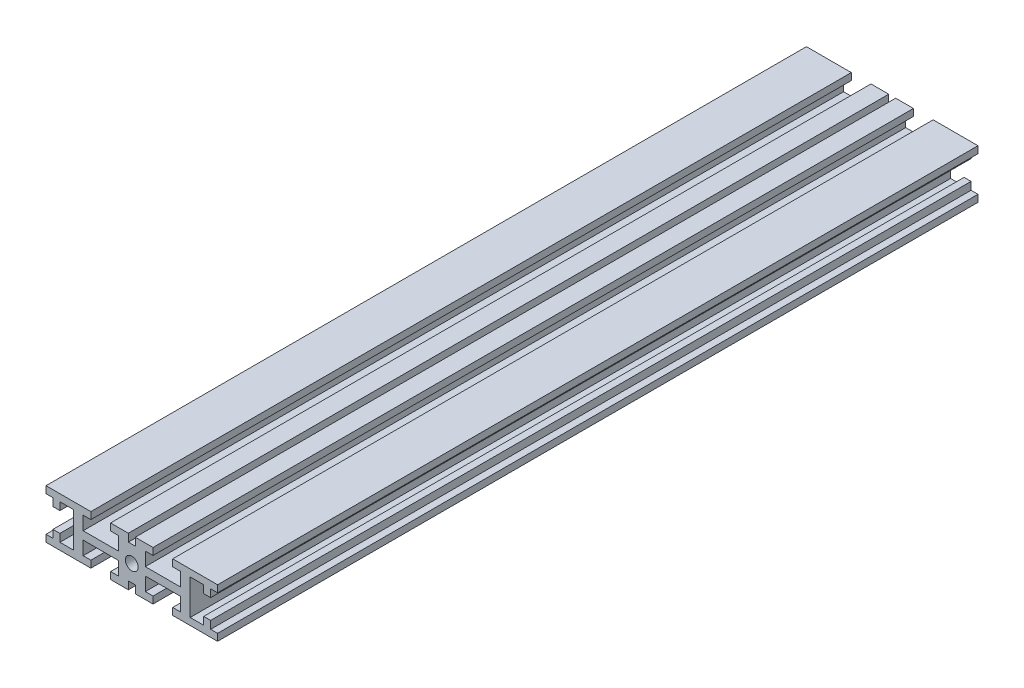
ISO-10303-21;
HEADER;
FILE_DESCRIPTION(('STEP AP214'),'2;1');
FILE_NAME('part.step','',(''),(''),'','','');
FILE_SCHEMA(('AUTOMOTIVE_DESIGN { 1 0 10303 214 1 1 1 1 }'));
ENDSEC;
DATA;
#1=APPLICATION_CONTEXT('core data for automotive mechanical design processes');
#2=APPLICATION_PROTOCOL_DEFINITION('international standard','automotive_design',2000,#1);
#3=PRODUCT_CONTEXT('',#1,'mechanical');
#4=PRODUCT('Part','Part','',(#3));
#5=PRODUCT_RELATED_PRODUCT_CATEGORY('part','',(#4));
#6=PRODUCT_DEFINITION_FORMATION('','',#4);
#7=PRODUCT_DEFINITION_CONTEXT('part definition',#1,'design');
#8=PRODUCT_DEFINITION('design','',#6,#7);
#9=PRODUCT_DEFINITION_SHAPE('','',#8);
#10=(LENGTH_UNIT() NAMED_UNIT(*) SI_UNIT(.MILLI.,.METRE.));
#11=(NAMED_UNIT(*) PLANE_ANGLE_UNIT() SI_UNIT($,.RADIAN.));
#12=(NAMED_UNIT(*) SI_UNIT($,.STERADIAN.) SOLID_ANGLE_UNIT());
#13=UNCERTAINTY_MEASURE_WITH_UNIT(LENGTH_MEASURE(1.E-05),#10,'distance_accuracy_value','');
#14=(GEOMETRIC_REPRESENTATION_CONTEXT(3) GLOBAL_UNCERTAINTY_ASSIGNED_CONTEXT((#13)) GLOBAL_UNIT_ASSIGNED_CONTEXT((#10,
#11,#12)) REPRESENTATION_CONTEXT('',''));
#15=CARTESIAN_POINT('',(0.,0.,0.));
#16=DIRECTION('',(0.,0.,1.));
#17=DIRECTION('',(1.,0.,0.));
#18=AXIS2_PLACEMENT_3D('',#15,#16,#17);
#19=CARTESIAN_POINT('',(5.5,6.35,197.));
#20=DIRECTION('',(0.,-1.,0.));
#21=DIRECTION('',(0.,0.,-1.));
#22=AXIS2_PLACEMENT_3D('',#19,#20,#21);
#23=PLANE('',#22);
#24=DIRECTION('',(-1.,0.,0.));
#25=VECTOR('',#24,1.);
#26=CARTESIAN_POINT('',(5.5,6.35,0.));
#27=LINE('',#26,#25);
#28=CARTESIAN_POINT('',(5.5,6.35,0.));
#29=VERTEX_POINT('',#28);
#30=CARTESIAN_POINT('',(0.9,6.35,0.));
#31=VERTEX_POINT('',#30);
#32=EDGE_CURVE('E479',#29,#31,#27,.T.);
#33=ORIENTED_EDGE('',*,*,#32,.T.);
#34=DIRECTION('',(0.,0.,1.));
#35=VECTOR('',#34,1.);
#36=CARTESIAN_POINT('',(0.9,6.35,0.));
#37=LINE('',#36,#35);
#38=CARTESIAN_POINT('',(0.9,6.35,197.));
#39=VERTEX_POINT('',#38);
#40=EDGE_CURVE('E460',#31,#39,#37,.T.);
#41=ORIENTED_EDGE('',*,*,#40,.T.);
#42=DIRECTION('',(-1.,0.,0.));
#43=VECTOR('',#42,1.);
#44=CARTESIAN_POINT('',(5.5,6.35,197.));
#45=LINE('',#44,#43);
#46=CARTESIAN_POINT('',(5.5,6.35,197.));
#47=VERTEX_POINT('',#46);
#48=EDGE_CURVE('E821',#47,#39,#45,.T.);
#49=ORIENTED_EDGE('',*,*,#48,.F.);
#50=DIRECTION('',(0.,0.,-1.));
#51=VECTOR('',#50,1.);
#52=CARTESIAN_POINT('',(5.5,6.35,197.));
#53=LINE('',#52,#51);
#54=EDGE_CURVE('E485',#47,#29,#53,.T.);
#55=ORIENTED_EDGE('',*,*,#54,.T.);
#56=EDGE_LOOP('',(#33,#41,#49,#55));
#57=FACE_BOUND('',#56,.T.);
#58=ADVANCED_FACE('F35',(#57),#23,.F.);
#59=CARTESIAN_POINT('',(-5.5,-6.35,197.));
#60=DIRECTION('',(0.,1.,0.));
#61=DIRECTION('',(-1.,0.,0.));
#62=AXIS2_PLACEMENT_3D('',#59,#60,#61);
#63=PLANE('',#62);
#64=DIRECTION('',(1.,0.,0.));
#65=VECTOR('',#64,1.);
#66=CARTESIAN_POINT('',(-5.5,-6.35,0.));
#67=LINE('',#66,#65);
#68=CARTESIAN_POINT('',(-5.5,-6.35,0.));
#69=VERTEX_POINT('',#68);
#70=CARTESIAN_POINT('',(-0.899999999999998,-6.35,0.));
#71=VERTEX_POINT('',#70);
#72=EDGE_CURVE('E737',#69,#71,#67,.T.);
#73=ORIENTED_EDGE('',*,*,#72,.T.);
#74=DIRECTION('',(0.,0.,1.));
#75=VECTOR('',#74,1.);
#76=CARTESIAN_POINT('',(-0.899999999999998,-6.35,0.));
#77=LINE('',#76,#75);
#78=CARTESIAN_POINT('',(-0.899999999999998,-6.35,197.));
#79=VERTEX_POINT('',#78);
#80=EDGE_CURVE('E1083',#71,#79,#77,.T.);
#81=ORIENTED_EDGE('',*,*,#80,.T.);
#82=DIRECTION('',(1.,0.,0.));
#83=VECTOR('',#82,1.);
#84=CARTESIAN_POINT('',(-5.5,-6.35,197.));
#85=LINE('',#84,#83);
#86=CARTESIAN_POINT('',(-5.5,-6.35,197.));
#87=VERTEX_POINT('',#86);
#88=EDGE_CURVE('E892',#87,#79,#85,.T.);
#89=ORIENTED_EDGE('',*,*,#88,.F.);
#90=DIRECTION('',(0.,0.,-1.));
#91=VECTOR('',#90,1.);
#92=CARTESIAN_POINT('',(-5.5,-6.35,197.));
#93=LINE('',#92,#91);
#94=EDGE_CURVE('E680',#87,#69,#93,.T.);
#95=ORIENTED_EDGE('',*,*,#94,.T.);
#96=EDGE_LOOP('',(#73,#81,#89,#95));
#97=FACE_BOUND('',#96,.T.);
#98=ADVANCED_FACE('F1142',(#97),#63,.F.);
#99=CARTESIAN_POINT('',(0.,0.,197.));
#100=DIRECTION('',(0.,0.,-1.));
#101=DIRECTION('',(-1.,0.,0.));
#102=AXIS2_PLACEMENT_3D('',#99,#100,#101);
#103=PLANE('',#102);
#104=ORIENTED_EDGE('',*,*,#48,.T.);
#105=DIRECTION('',(0.,1.,0.));
#106=VECTOR('',#105,1.);
#107=CARTESIAN_POINT('',(0.9,6.35,197.));
#108=LINE('',#107,#106);
#109=CARTESIAN_POINT('',(0.9,4.35,197.));
#110=VERTEX_POINT('',#109);
#111=EDGE_CURVE('E466',#110,#39,#108,.T.);
#112=ORIENTED_EDGE('',*,*,#111,.F.);
#113=DIRECTION('',(1.,0.,0.));
#114=VECTOR('',#113,1.);
#115=CARTESIAN_POINT('',(0.9,4.35,197.));
#116=LINE('',#115,#114);
#117=CARTESIAN_POINT('',(-0.9,4.35,197.));
#118=VERTEX_POINT('',#117);
#119=EDGE_CURVE('E481',#118,#110,#116,.T.);
#120=ORIENTED_EDGE('',*,*,#119,.F.);
#121=DIRECTION('',(0.,-1.,0.));
#122=VECTOR('',#121,1.);
#123=CARTESIAN_POINT('',(-0.9,6.35,197.));
#124=LINE('',#123,#122);
#125=CARTESIAN_POINT('',(-0.9,6.35,197.));
#126=VERTEX_POINT('',#125);
#127=EDGE_CURVE('E1109',#126,#118,#124,.T.);
#128=ORIENTED_EDGE('',*,*,#127,.F.);
#129=CARTESIAN_POINT('',(-5.5,6.35,197.));
#130=VERTEX_POINT('',#129);
#131=EDGE_CURVE('E815',#126,#130,#45,.T.);
#132=ORIENTED_EDGE('',*,*,#131,.T.);
#133=DIRECTION('',(0.,-1.,0.));
#134=VECTOR('',#133,1.);
#135=CARTESIAN_POINT('',(-5.5,4.54999999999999,197.));
#136=LINE('',#135,#134);
#137=CARTESIAN_POINT('',(-5.5,4.54999999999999,197.));
#138=VERTEX_POINT('',#137);
#139=EDGE_CURVE('E823',#130,#138,#136,.T.);
#140=ORIENTED_EDGE('',*,*,#139,.T.);
#141=DIRECTION('',(1.,0.,0.));
#142=VECTOR('',#141,1.);
#143=CARTESIAN_POINT('',(-3.5,4.54999999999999,197.));
#144=LINE('',#143,#142);
#145=CARTESIAN_POINT('',(-3.5,4.54999999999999,197.));
#146=VERTEX_POINT('',#145);
#147=EDGE_CURVE('E825',#138,#146,#144,.T.);
#148=ORIENTED_EDGE('',*,*,#147,.T.);
#149=DIRECTION('',(0.,-1.,0.));
#150=VECTOR('',#149,1.);
#151=CARTESIAN_POINT('',(-3.5,4.54999999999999,197.));
#152=LINE('',#151,#150);
#153=CARTESIAN_POINT('',(-3.5,1.04999999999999,197.));
#154=VERTEX_POINT('',#153);
#155=EDGE_CURVE('E827',#146,#154,#152,.T.);
#156=ORIENTED_EDGE('',*,*,#155,.T.);
#157=DIRECTION('',(-1.,0.,0.));
#158=VECTOR('',#157,1.);
#159=CARTESIAN_POINT('',(-3.5,1.04999999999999,197.));
#160=LINE('',#159,#158);
#161=CARTESIAN_POINT('',(-12.6,1.04999999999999,197.));
#162=VERTEX_POINT('',#161);
#163=EDGE_CURVE('E829',#154,#162,#160,.T.);
#164=ORIENTED_EDGE('',*,*,#163,.T.);
#165=DIRECTION('',(0.,1.,0.));
#166=VECTOR('',#165,1.);
#167=CARTESIAN_POINT('',(-12.6,1.04999999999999,197.));
#168=LINE('',#167,#166);
#169=CARTESIAN_POINT('',(-12.6,4.55,197.));
#170=VERTEX_POINT('',#169);
#171=EDGE_CURVE('E831',#162,#170,#168,.T.);
#172=ORIENTED_EDGE('',*,*,#171,.T.);
#173=DIRECTION('',(1.,0.,0.));
#174=VECTOR('',#173,1.);
#175=CARTESIAN_POINT('',(-12.6,4.55,197.));
#176=LINE('',#175,#174);
#177=CARTESIAN_POINT('',(-10.6,4.55,197.));
#178=VERTEX_POINT('',#177);
#179=EDGE_CURVE('E833',#170,#178,#176,.T.);
#180=ORIENTED_EDGE('',*,*,#179,.T.);
#181=DIRECTION('',(0.,1.,0.));
#182=VECTOR('',#181,1.);
#183=CARTESIAN_POINT('',(-10.6,4.55,197.));
#184=LINE('',#183,#182);
#185=CARTESIAN_POINT('',(-10.6,6.35,197.));
#186=VERTEX_POINT('',#185);
#187=EDGE_CURVE('E835',#178,#186,#184,.T.);
#188=ORIENTED_EDGE('',*,*,#187,.T.);
#189=DIRECTION('',(-1.,0.,0.));
#190=VECTOR('',#189,1.);
#191=CARTESIAN_POINT('',(-10.6,6.35,197.));
#192=LINE('',#191,#190);
#193=CARTESIAN_POINT('',(-22.225,6.35,197.));
#194=VERTEX_POINT('',#193);
#195=EDGE_CURVE('E837',#186,#194,#192,.T.);
#196=ORIENTED_EDGE('',*,*,#195,.T.);
#197=DIRECTION('',(0.,-1.,0.));
#198=VECTOR('',#197,1.);
#199=CARTESIAN_POINT('',(-22.225,6.35,197.));
#200=LINE('',#199,#198);
#201=CARTESIAN_POINT('',(-22.225,4.55,197.));
#202=VERTEX_POINT('',#201);
#203=EDGE_CURVE('E839',#194,#202,#200,.T.);
#204=ORIENTED_EDGE('',*,*,#203,.T.);
#205=DIRECTION('',(1.,0.,0.));
#206=VECTOR('',#205,1.);
#207=CARTESIAN_POINT('',(-20.425,4.55,197.));
#208=LINE('',#207,#206);
#209=CARTESIAN_POINT('',(-20.425,4.55,197.));
#210=VERTEX_POINT('',#209);
#211=EDGE_CURVE('E841',#202,#210,#208,.T.);
#212=ORIENTED_EDGE('',*,*,#211,.T.);
#213=DIRECTION('',(0.,-1.,0.));
#214=VECTOR('',#213,1.);
#215=CARTESIAN_POINT('',(-20.425,2.55,197.));
#216=LINE('',#215,#214);
#217=CARTESIAN_POINT('',(-20.425,2.55,197.));
#218=VERTEX_POINT('',#217);
#219=EDGE_CURVE('E843',#210,#218,#216,.T.);
#220=ORIENTED_EDGE('',*,*,#219,.T.);
#221=DIRECTION('',(1.,0.,0.));
#222=VECTOR('',#221,1.);
#223=CARTESIAN_POINT('',(-18.625,2.55,197.));
#224=LINE('',#223,#222);
#225=CARTESIAN_POINT('',(-18.625,2.55,197.));
#226=VERTEX_POINT('',#225);
#227=EDGE_CURVE('E845',#218,#226,#224,.T.);
#228=ORIENTED_EDGE('',*,*,#227,.T.);
#229=DIRECTION('',(0.,1.,0.));
#230=VECTOR('',#229,1.);
#231=CARTESIAN_POINT('',(-18.625,4.55,197.));
#232=LINE('',#231,#230);
#233=CARTESIAN_POINT('',(-18.625,4.55,197.));
#234=VERTEX_POINT('',#233);
#235=EDGE_CURVE('E847',#226,#234,#232,.T.);
#236=ORIENTED_EDGE('',*,*,#235,.T.);
#237=DIRECTION('',(1.,0.,0.));
#238=VECTOR('',#237,1.);
#239=CARTESIAN_POINT('',(-15.125,4.55,197.));
#240=LINE('',#239,#238);
#241=CARTESIAN_POINT('',(-15.125,4.55,197.));
#242=VERTEX_POINT('',#241);
#243=EDGE_CURVE('E849',#234,#242,#240,.T.);
#244=ORIENTED_EDGE('',*,*,#243,.T.);
#245=DIRECTION('',(0.,-1.,0.));
#246=VECTOR('',#245,1.);
#247=CARTESIAN_POINT('',(-15.125,4.55,197.));
#248=LINE('',#247,#246);
#249=CARTESIAN_POINT('',(-15.125,-4.55,197.));
#250=VERTEX_POINT('',#249);
#251=EDGE_CURVE('E851',#242,#250,#248,.T.);
#252=ORIENTED_EDGE('',*,*,#251,.T.);
#253=DIRECTION('',(-1.,0.,0.));
#254=VECTOR('',#253,1.);
#255=CARTESIAN_POINT('',(-18.625,-4.55,197.));
#256=LINE('',#255,#254);
#257=CARTESIAN_POINT('',(-18.625,-4.55,197.));
#258=VERTEX_POINT('',#257);
#259=EDGE_CURVE('E853',#250,#258,#256,.T.);
#260=ORIENTED_EDGE('',*,*,#259,.T.);
#261=DIRECTION('',(0.,1.,0.));
#262=VECTOR('',#261,1.);
#263=CARTESIAN_POINT('',(-18.625,-4.55,197.));
#264=LINE('',#263,#262);
#265=CARTESIAN_POINT('',(-18.625,-2.55,197.));
#266=VERTEX_POINT('',#265);
#267=EDGE_CURVE('E855',#258,#266,#264,.T.);
#268=ORIENTED_EDGE('',*,*,#267,.T.);
#269=DIRECTION('',(-1.,0.,0.));
#270=VECTOR('',#269,1.);
#271=CARTESIAN_POINT('',(-18.625,-2.55,197.));
#272=LINE('',#271,#270);
#273=CARTESIAN_POINT('',(-20.425,-2.55,197.));
#274=VERTEX_POINT('',#273);
#275=EDGE_CURVE('E857',#266,#274,#272,.T.);
#276=ORIENTED_EDGE('',*,*,#275,.T.);
#277=DIRECTION('',(0.,-1.,0.));
#278=VECTOR('',#277,1.);
#279=CARTESIAN_POINT('',(-20.425,-2.55,197.));
#280=LINE('',#279,#278);
#281=CARTESIAN_POINT('',(-20.425,-4.55,197.));
#282=VERTEX_POINT('',#281);
#283=EDGE_CURVE('E535',#274,#282,#280,.T.);
#284=ORIENTED_EDGE('',*,*,#283,.T.);
#285=DIRECTION('',(-1.,0.,0.));
#286=VECTOR('',#285,1.);
#287=CARTESIAN_POINT('',(-20.425,-4.55,197.));
#288=LINE('',#287,#286);
#289=CARTESIAN_POINT('',(-22.225,-4.55,197.));
#290=VERTEX_POINT('',#289);
#291=EDGE_CURVE('E530',#282,#290,#288,.T.);
#292=ORIENTED_EDGE('',*,*,#291,.T.);
#293=DIRECTION('',(0.,-1.,0.));
#294=VECTOR('',#293,1.);
#295=CARTESIAN_POINT('',(-22.225,-6.35,197.));
#296=LINE('',#295,#294);
#297=CARTESIAN_POINT('',(-22.225,-6.35,197.));
#298=VERTEX_POINT('',#297);
#299=EDGE_CURVE('E874',#290,#298,#296,.T.);
#300=ORIENTED_EDGE('',*,*,#299,.T.);
#301=DIRECTION('',(1.,0.,0.));
#302=VECTOR('',#301,1.);
#303=CARTESIAN_POINT('',(-22.225,-6.35,197.));
#304=LINE('',#303,#302);
#305=CARTESIAN_POINT('',(-10.6,-6.35,197.));
#306=VERTEX_POINT('',#305);
#307=EDGE_CURVE('E711',#298,#306,#304,.T.);
#308=ORIENTED_EDGE('',*,*,#307,.T.);
#309=DIRECTION('',(0.,1.,0.));
#310=VECTOR('',#309,1.);
#311=CARTESIAN_POINT('',(-10.6,-4.55,197.));
#312=LINE('',#311,#310);
#313=CARTESIAN_POINT('',(-10.6,-4.55,197.));
#314=VERTEX_POINT('',#313);
#315=EDGE_CURVE('E877',#306,#314,#312,.T.);
#316=ORIENTED_EDGE('',*,*,#315,.T.);
#317=DIRECTION('',(-1.,0.,0.));
#318=VECTOR('',#317,1.);
#319=CARTESIAN_POINT('',(-12.6,-4.55,197.));
#320=LINE('',#319,#318);
#321=CARTESIAN_POINT('',(-12.6,-4.55,197.));
#322=VERTEX_POINT('',#321);
#323=EDGE_CURVE('E879',#314,#322,#320,.T.);
#324=ORIENTED_EDGE('',*,*,#323,.T.);
#325=DIRECTION('',(0.,1.,0.));
#326=VECTOR('',#325,1.);
#327=CARTESIAN_POINT('',(-12.6,-1.05,197.));
#328=LINE('',#327,#326);
#329=CARTESIAN_POINT('',(-12.6,-1.05,197.));
#330=VERTEX_POINT('',#329);
#331=EDGE_CURVE('E881',#322,#330,#328,.T.);
#332=ORIENTED_EDGE('',*,*,#331,.T.);
#333=DIRECTION('',(1.,0.,0.));
#334=VECTOR('',#333,1.);
#335=CARTESIAN_POINT('',(-3.5,-1.05,197.));
#336=LINE('',#335,#334);
#337=CARTESIAN_POINT('',(-3.5,-1.05,197.));
#338=VERTEX_POINT('',#337);
#339=EDGE_CURVE('E883',#330,#338,#336,.T.);
#340=ORIENTED_EDGE('',*,*,#339,.T.);
#341=DIRECTION('',(0.,-1.,0.));
#342=VECTOR('',#341,1.);
#343=CARTESIAN_POINT('',(-3.5,-4.55,197.));
#344=LINE('',#343,#342);
#345=CARTESIAN_POINT('',(-3.5,-4.55,197.));
#346=VERTEX_POINT('',#345);
#347=EDGE_CURVE('E885',#338,#346,#344,.T.);
#348=ORIENTED_EDGE('',*,*,#347,.T.);
#349=DIRECTION('',(-1.,0.,0.));
#350=VECTOR('',#349,1.);
#351=CARTESIAN_POINT('',(-5.5,-4.55,197.));
#352=LINE('',#351,#350);
#353=CARTESIAN_POINT('',(-5.5,-4.55,197.));
#354=VERTEX_POINT('',#353);
#355=EDGE_CURVE('E887',#346,#354,#352,.T.);
#356=ORIENTED_EDGE('',*,*,#355,.T.);
#357=DIRECTION('',(0.,-1.,0.));
#358=VECTOR('',#357,1.);
#359=CARTESIAN_POINT('',(-5.5,-4.55,197.));
#360=LINE('',#359,#358);
#361=EDGE_CURVE('E889',#354,#87,#360,.T.);
#362=ORIENTED_EDGE('',*,*,#361,.T.);
#363=ORIENTED_EDGE('',*,*,#88,.T.);
#364=DIRECTION('',(0.,-1.,0.));
#365=VECTOR('',#364,1.);
#366=CARTESIAN_POINT('',(-0.899999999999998,-6.35,197.));
#367=LINE('',#366,#365);
#368=CARTESIAN_POINT('',(-0.899999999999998,-4.35,197.));
#369=VERTEX_POINT('',#368);
#370=EDGE_CURVE('E1096',#369,#79,#367,.T.);
#371=ORIENTED_EDGE('',*,*,#370,.F.);
#372=DIRECTION('',(-1.,0.,0.));
#373=VECTOR('',#372,1.);
#374=CARTESIAN_POINT('',(-0.899999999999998,-4.35,197.));
#375=LINE('',#374,#373);
#376=CARTESIAN_POINT('',(0.900000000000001,-4.35,197.));
#377=VERTEX_POINT('',#376);
#378=EDGE_CURVE('E1090',#377,#369,#375,.T.);
#379=ORIENTED_EDGE('',*,*,#378,.F.);
#380=DIRECTION('',(0.,1.,0.));
#381=VECTOR('',#380,1.);
#382=CARTESIAN_POINT('',(0.900000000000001,-6.35,197.));
#383=LINE('',#382,#381);
#384=CARTESIAN_POINT('',(0.900000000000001,-6.35,197.));
#385=VERTEX_POINT('',#384);
#386=EDGE_CURVE('E1094',#385,#377,#383,.T.);
#387=ORIENTED_EDGE('',*,*,#386,.F.);
#388=CARTESIAN_POINT('',(5.5,-6.35,197.));
#389=VERTEX_POINT('',#388);
#390=EDGE_CURVE('E891',#385,#389,#85,.T.);
#391=ORIENTED_EDGE('',*,*,#390,.T.);
#392=DIRECTION('',(0.,1.,0.));
#393=VECTOR('',#392,1.);
#394=CARTESIAN_POINT('',(5.5,-4.55,197.));
#395=LINE('',#394,#393);
#396=CARTESIAN_POINT('',(5.5,-4.55,197.));
#397=VERTEX_POINT('',#396);
#398=EDGE_CURVE('E895',#389,#397,#395,.T.);
#399=ORIENTED_EDGE('',*,*,#398,.T.);
#400=DIRECTION('',(-1.,0.,0.));
#401=VECTOR('',#400,1.);
#402=CARTESIAN_POINT('',(5.5,-4.55,197.));
#403=LINE('',#402,#401);
#404=CARTESIAN_POINT('',(3.5,-4.55,197.));
#405=VERTEX_POINT('',#404);
#406=EDGE_CURVE('E897',#397,#405,#403,.T.);
#407=ORIENTED_EDGE('',*,*,#406,.T.);
#408=DIRECTION('',(0.,1.,0.));
#409=VECTOR('',#408,1.);
#410=CARTESIAN_POINT('',(3.5,-4.55,197.));
#411=LINE('',#410,#409);
#412=CARTESIAN_POINT('',(3.5,-1.05,197.));
#413=VERTEX_POINT('',#412);
#414=EDGE_CURVE('E899',#405,#413,#411,.T.);
#415=ORIENTED_EDGE('',*,*,#414,.T.);
#416=DIRECTION('',(1.,0.,0.));
#417=VECTOR('',#416,1.);
#418=CARTESIAN_POINT('',(3.5,-1.05,197.));
#419=LINE('',#418,#417);
#420=CARTESIAN_POINT('',(12.6,-1.05,197.));
#421=VERTEX_POINT('',#420);
#422=EDGE_CURVE('E901',#413,#421,#419,.T.);
#423=ORIENTED_EDGE('',*,*,#422,.T.);
#424=DIRECTION('',(0.,-1.,0.));
#425=VECTOR('',#424,1.);
#426=CARTESIAN_POINT('',(12.6,-1.05,197.));
#427=LINE('',#426,#425);
#428=CARTESIAN_POINT('',(12.6,-4.55,197.));
#429=VERTEX_POINT('',#428);
#430=EDGE_CURVE('E903',#421,#429,#427,.T.);
#431=ORIENTED_EDGE('',*,*,#430,.T.);
#432=DIRECTION('',(-1.,0.,0.));
#433=VECTOR('',#432,1.);
#434=CARTESIAN_POINT('',(12.6,-4.55,197.));
#435=LINE('',#434,#433);
#436=CARTESIAN_POINT('',(10.6,-4.55,197.));
#437=VERTEX_POINT('',#436);
#438=EDGE_CURVE('E905',#429,#437,#435,.T.);
#439=ORIENTED_EDGE('',*,*,#438,.T.);
#440=DIRECTION('',(0.,-1.,0.));
#441=VECTOR('',#440,1.);
#442=CARTESIAN_POINT('',(10.6,-4.55,197.));
#443=LINE('',#442,#441);
#444=CARTESIAN_POINT('',(10.6,-6.35,197.));
#445=VERTEX_POINT('',#444);
#446=EDGE_CURVE('E907',#437,#445,#443,.T.);
#447=ORIENTED_EDGE('',*,*,#446,.T.);
#448=DIRECTION('',(1.,0.,0.));
#449=VECTOR('',#448,1.);
#450=CARTESIAN_POINT('',(22.225,-6.35,197.));
#451=LINE('',#450,#449);
#452=CARTESIAN_POINT('',(22.225,-6.35,197.));
#453=VERTEX_POINT('',#452);
#454=EDGE_CURVE('E909',#445,#453,#451,.T.);
#455=ORIENTED_EDGE('',*,*,#454,.T.);
#456=DIRECTION('',(0.,1.,0.));
#457=VECTOR('',#456,1.);
#458=CARTESIAN_POINT('',(22.225,-4.55,197.));
#459=LINE('',#458,#457);
#460=CARTESIAN_POINT('',(22.225,-4.55,197.));
#461=VERTEX_POINT('',#460);
#462=EDGE_CURVE('E911',#453,#461,#459,.T.);
#463=ORIENTED_EDGE('',*,*,#462,.T.);
#464=DIRECTION('',(-1.,0.,0.));
#465=VECTOR('',#464,1.);
#466=CARTESIAN_POINT('',(20.425,-4.55,197.));
#467=LINE('',#466,#465);
#468=CARTESIAN_POINT('',(20.425,-4.55,197.));
#469=VERTEX_POINT('',#468);
#470=EDGE_CURVE('E913',#461,#469,#467,.T.);
#471=ORIENTED_EDGE('',*,*,#470,.T.);
#472=DIRECTION('',(0.,1.,0.));
#473=VECTOR('',#472,1.);
#474=CARTESIAN_POINT('',(20.425,-2.55,197.));
#475=LINE('',#474,#473);
#476=CARTESIAN_POINT('',(20.425,-2.55,197.));
#477=VERTEX_POINT('',#476);
#478=EDGE_CURVE('E915',#469,#477,#475,.T.);
#479=ORIENTED_EDGE('',*,*,#478,.T.);
#480=DIRECTION('',(-1.,0.,0.));
#481=VECTOR('',#480,1.);
#482=CARTESIAN_POINT('',(18.625,-2.55,197.));
#483=LINE('',#482,#481);
#484=CARTESIAN_POINT('',(18.625,-2.55,197.));
#485=VERTEX_POINT('',#484);
#486=EDGE_CURVE('E917',#477,#485,#483,.T.);
#487=ORIENTED_EDGE('',*,*,#486,.T.);
#488=DIRECTION('',(0.,-1.,0.));
#489=VECTOR('',#488,1.);
#490=CARTESIAN_POINT('',(18.625,-4.55,197.));
#491=LINE('',#490,#489);
#492=CARTESIAN_POINT('',(18.625,-4.55,197.));
#493=VERTEX_POINT('',#492);
#494=EDGE_CURVE('E919',#485,#493,#491,.T.);
#495=ORIENTED_EDGE('',*,*,#494,.T.);
#496=DIRECTION('',(-1.,0.,0.));
#497=VECTOR('',#496,1.);
#498=CARTESIAN_POINT('',(18.625,-4.55,197.));
#499=LINE('',#498,#497);
#500=CARTESIAN_POINT('',(15.125,-4.55,197.));
#501=VERTEX_POINT('',#500);
#502=EDGE_CURVE('E921',#493,#501,#499,.T.);
#503=ORIENTED_EDGE('',*,*,#502,.T.);
#504=DIRECTION('',(0.,1.,0.));
#505=VECTOR('',#504,1.);
#506=CARTESIAN_POINT('',(15.125,4.55,197.));
#507=LINE('',#506,#505);
#508=CARTESIAN_POINT('',(15.125,4.55,197.));
#509=VERTEX_POINT('',#508);
#510=EDGE_CURVE('E923',#501,#509,#507,.T.);
#511=ORIENTED_EDGE('',*,*,#510,.T.);
#512=DIRECTION('',(1.,0.,0.));
#513=VECTOR('',#512,1.);
#514=CARTESIAN_POINT('',(15.125,4.55,197.));
#515=LINE('',#514,#513);
#516=CARTESIAN_POINT('',(18.625,4.55,197.));
#517=VERTEX_POINT('',#516);
#518=EDGE_CURVE('E925',#509,#517,#515,.T.);
#519=ORIENTED_EDGE('',*,*,#518,.T.);
#520=DIRECTION('',(0.,-1.,0.));
#521=VECTOR('',#520,1.);
#522=CARTESIAN_POINT('',(18.625,4.55,197.));
#523=LINE('',#522,#521);
#524=CARTESIAN_POINT('',(18.625,2.55,197.));
#525=VERTEX_POINT('',#524);
#526=EDGE_CURVE('E927',#517,#525,#523,.T.);
#527=ORIENTED_EDGE('',*,*,#526,.T.);
#528=DIRECTION('',(1.,0.,0.));
#529=VECTOR('',#528,1.);
#530=CARTESIAN_POINT('',(18.625,2.55,197.));
#531=LINE('',#530,#529);
#532=CARTESIAN_POINT('',(20.425,2.55,197.));
#533=VERTEX_POINT('',#532);
#534=EDGE_CURVE('E929',#525,#533,#531,.T.);
#535=ORIENTED_EDGE('',*,*,#534,.T.);
#536=DIRECTION('',(0.,1.,0.));
#537=VECTOR('',#536,1.);
#538=CARTESIAN_POINT('',(20.425,2.55,197.));
#539=LINE('',#538,#537);
#540=CARTESIAN_POINT('',(20.425,4.55,197.));
#541=VERTEX_POINT('',#540);
#542=EDGE_CURVE('E931',#533,#541,#539,.T.);
#543=ORIENTED_EDGE('',*,*,#542,.T.);
#544=DIRECTION('',(1.,0.,0.));
#545=VECTOR('',#544,1.);
#546=CARTESIAN_POINT('',(20.425,4.55,197.));
#547=LINE('',#546,#545);
#548=CARTESIAN_POINT('',(22.225,4.55,197.));
#549=VERTEX_POINT('',#548);
#550=EDGE_CURVE('E933',#541,#549,#547,.T.);
#551=ORIENTED_EDGE('',*,*,#550,.T.);
#552=DIRECTION('',(0.,1.,0.));
#553=VECTOR('',#552,1.);
#554=CARTESIAN_POINT('',(22.225,4.55,197.));
#555=LINE('',#554,#553);
#556=CARTESIAN_POINT('',(22.225,6.35,197.));
#557=VERTEX_POINT('',#556);
#558=EDGE_CURVE('E935',#549,#557,#555,.T.);
#559=ORIENTED_EDGE('',*,*,#558,.T.);
#560=DIRECTION('',(-1.,0.,0.));
#561=VECTOR('',#560,1.);
#562=CARTESIAN_POINT('',(10.6,6.35,197.));
#563=LINE('',#562,#561);
#564=CARTESIAN_POINT('',(10.6,6.35,197.));
#565=VERTEX_POINT('',#564);
#566=EDGE_CURVE('E937',#557,#565,#563,.T.);
#567=ORIENTED_EDGE('',*,*,#566,.T.);
#568=DIRECTION('',(0.,-1.,0.));
#569=VECTOR('',#568,1.);
#570=CARTESIAN_POINT('',(10.6,4.55,197.));
#571=LINE('',#570,#569);
#572=CARTESIAN_POINT('',(10.6,4.55,197.));
#573=VERTEX_POINT('',#572);
#574=EDGE_CURVE('E939',#565,#573,#571,.T.);
#575=ORIENTED_EDGE('',*,*,#574,.T.);
#576=DIRECTION('',(1.,0.,0.));
#577=VECTOR('',#576,1.);
#578=CARTESIAN_POINT('',(12.6,4.55,197.));
#579=LINE('',#578,#577);
#580=CARTESIAN_POINT('',(12.6,4.55,197.));
#581=VERTEX_POINT('',#580);
#582=EDGE_CURVE('E941',#573,#581,#579,.T.);
#583=ORIENTED_EDGE('',*,*,#582,.T.);
#584=DIRECTION('',(0.,-1.,0.));
#585=VECTOR('',#584,1.);
#586=CARTESIAN_POINT('',(12.6,1.04999999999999,197.));
#587=LINE('',#586,#585);
#588=CARTESIAN_POINT('',(12.6,1.04999999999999,197.));
#589=VERTEX_POINT('',#588);
#590=EDGE_CURVE('E943',#581,#589,#587,.T.);
#591=ORIENTED_EDGE('',*,*,#590,.T.);
#592=DIRECTION('',(-1.,0.,0.));
#593=VECTOR('',#592,1.);
#594=CARTESIAN_POINT('',(3.5,1.04999999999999,197.));
#595=LINE('',#594,#593);
#596=CARTESIAN_POINT('',(3.5,1.04999999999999,197.));
#597=VERTEX_POINT('',#596);
#598=EDGE_CURVE('E817',#589,#597,#595,.T.);
#599=ORIENTED_EDGE('',*,*,#598,.T.);
#600=DIRECTION('',(0.,1.,0.));
#601=VECTOR('',#600,1.);
#602=CARTESIAN_POINT('',(3.5,4.54999999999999,197.));
#603=LINE('',#602,#601);
#604=CARTESIAN_POINT('',(3.5,4.54999999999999,197.));
#605=VERTEX_POINT('',#604);
#606=EDGE_CURVE('E813',#597,#605,#603,.T.);
#607=ORIENTED_EDGE('',*,*,#606,.T.);
#608=DIRECTION('',(1.,0.,0.));
#609=VECTOR('',#608,1.);
#610=CARTESIAN_POINT('',(3.5,4.54999999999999,197.));
#611=LINE('',#610,#609);
#612=CARTESIAN_POINT('',(5.5,4.54999999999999,197.));
#613=VERTEX_POINT('',#612);
#614=EDGE_CURVE('E810',#605,#613,#611,.T.);
#615=ORIENTED_EDGE('',*,*,#614,.T.);
#616=DIRECTION('',(0.,1.,0.));
#617=VECTOR('',#616,1.);
#618=CARTESIAN_POINT('',(5.5,4.54999999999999,197.));
#619=LINE('',#618,#617);
#620=EDGE_CURVE('E812',#613,#47,#619,.T.);
#621=ORIENTED_EDGE('',*,*,#620,.T.);
#622=EDGE_LOOP('',(#104,#112,#120,#128,#132,#140,#148,#156,#164,#172,#180,#188,#196,#204,#212,
#220,#228,#236,#244,#252,#260,#268,#276,#284,#292,#300,#308,#316,#324,#332,#340,#348,#356,#362,
#363,#371,#379,#387,#391,#399,#407,#415,#423,#431,#439,#447,#455,#463,#471,#479,#487,#495,#503,
#511,#519,#527,#535,#543,#551,#559,#567,#575,#583,#591,#599,#607,#615,#621));
#623=FACE_BOUND('',#622,.T.);
#624=CARTESIAN_POINT('',(0.,0.,197.));
#625=DIRECTION('',(0.,0.,1.));
#626=DIRECTION('',(1.,0.,0.));
#627=AXIS2_PLACEMENT_3D('',#624,#625,#626);
#628=CIRCLE('',#627,1.64999999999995);
#629=CARTESIAN_POINT('',(1.64999999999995,0.,197.));
#630=VERTEX_POINT('',#629);
#631=EDGE_CURVE('E864',#630,#630,#628,.T.);
#632=ORIENTED_EDGE('',*,*,#631,.F.);
#633=EDGE_LOOP('',(#632));
#634=FACE_BOUND('',#633,.T.);
#635=ADVANCED_FACE('F945',(#623,#634),#103,.F.);
#636=CARTESIAN_POINT('',(0.,0.,0.));
#637=DIRECTION('',(0.,0.,-1.));
#638=DIRECTION('',(-1.,0.,0.));
#639=AXIS2_PLACEMENT_3D('',#636,#637,#638);
#640=PLANE('',#639);
#641=DIRECTION('',(0.,1.,0.));
#642=VECTOR('',#641,1.);
#643=CARTESIAN_POINT('',(0.9,6.35,0.));
#644=LINE('',#643,#642);
#645=CARTESIAN_POINT('',(0.9,4.35,0.));
#646=VERTEX_POINT('',#645);
#647=EDGE_CURVE('E463',#646,#31,#644,.T.);
#648=ORIENTED_EDGE('',*,*,#647,.T.);
#649=ORIENTED_EDGE('',*,*,#32,.F.);
#650=DIRECTION('',(0.,1.,0.));
#651=VECTOR('',#650,1.);
#652=CARTESIAN_POINT('',(5.5,4.54999999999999,0.));
#653=LINE('',#652,#651);
#654=CARTESIAN_POINT('',(5.5,4.54999999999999,0.));
#655=VERTEX_POINT('',#654);
#656=EDGE_CURVE('E491',#655,#29,#653,.T.);
#657=ORIENTED_EDGE('',*,*,#656,.F.);
#658=DIRECTION('',(1.,0.,0.));
#659=VECTOR('',#658,1.);
#660=CARTESIAN_POINT('',(3.5,4.54999999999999,0.));
#661=LINE('',#660,#659);
#662=CARTESIAN_POINT('',(3.5,4.54999999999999,0.));
#663=VERTEX_POINT('',#662);
#664=EDGE_CURVE('E793',#663,#655,#661,.T.);
#665=ORIENTED_EDGE('',*,*,#664,.F.);
#666=DIRECTION('',(0.,1.,0.));
#667=VECTOR('',#666,1.);
#668=CARTESIAN_POINT('',(3.5,4.54999999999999,0.));
#669=LINE('',#668,#667);
#670=CARTESIAN_POINT('',(3.5,1.04999999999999,0.));
#671=VERTEX_POINT('',#670);
#672=EDGE_CURVE('E792',#671,#663,#669,.T.);
#673=ORIENTED_EDGE('',*,*,#672,.F.);
#674=DIRECTION('',(-1.,0.,0.));
#675=VECTOR('',#674,1.);
#676=CARTESIAN_POINT('',(3.5,1.04999999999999,0.));
#677=LINE('',#676,#675);
#678=CARTESIAN_POINT('',(12.6,1.04999999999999,0.));
#679=VERTEX_POINT('',#678);
#680=EDGE_CURVE('E790',#679,#671,#677,.T.);
#681=ORIENTED_EDGE('',*,*,#680,.F.);
#682=DIRECTION('',(0.,-1.,0.));
#683=VECTOR('',#682,1.);
#684=CARTESIAN_POINT('',(12.6,1.04999999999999,0.));
#685=LINE('',#684,#683);
#686=CARTESIAN_POINT('',(12.6,4.55,0.));
#687=VERTEX_POINT('',#686);
#688=EDGE_CURVE('E788',#687,#679,#685,.T.);
#689=ORIENTED_EDGE('',*,*,#688,.F.);
#690=DIRECTION('',(1.,0.,0.));
#691=VECTOR('',#690,1.);
#692=CARTESIAN_POINT('',(12.6,4.55,0.));
#693=LINE('',#692,#691);
#694=CARTESIAN_POINT('',(10.6,4.55,0.));
#695=VERTEX_POINT('',#694);
#696=EDGE_CURVE('E786',#695,#687,#693,.T.);
#697=ORIENTED_EDGE('',*,*,#696,.F.);
#698=DIRECTION('',(0.,-1.,0.));
#699=VECTOR('',#698,1.);
#700=CARTESIAN_POINT('',(10.6,4.55,0.));
#701=LINE('',#700,#699);
#702=CARTESIAN_POINT('',(10.6,6.35,0.));
#703=VERTEX_POINT('',#702);
#704=EDGE_CURVE('E784',#703,#695,#701,.T.);
#705=ORIENTED_EDGE('',*,*,#704,.F.);
#706=DIRECTION('',(-1.,0.,0.));
#707=VECTOR('',#706,1.);
#708=CARTESIAN_POINT('',(10.6,6.35,0.));
#709=LINE('',#708,#707);
#710=CARTESIAN_POINT('',(22.225,6.35,0.));
#711=VERTEX_POINT('',#710);
#712=EDGE_CURVE('E782',#711,#703,#709,.T.);
#713=ORIENTED_EDGE('',*,*,#712,.F.);
#714=DIRECTION('',(0.,1.,0.));
#715=VECTOR('',#714,1.);
#716=CARTESIAN_POINT('',(22.225,4.55,0.));
#717=LINE('',#716,#715);
#718=CARTESIAN_POINT('',(22.225,4.55,0.));
#719=VERTEX_POINT('',#718);
#720=EDGE_CURVE('E780',#719,#711,#717,.T.);
#721=ORIENTED_EDGE('',*,*,#720,.F.);
#722=DIRECTION('',(1.,0.,0.));
#723=VECTOR('',#722,1.);
#724=CARTESIAN_POINT('',(20.425,4.55,0.));
#725=LINE('',#724,#723);
#726=CARTESIAN_POINT('',(20.425,4.55,0.));
#727=VERTEX_POINT('',#726);
#728=EDGE_CURVE('E778',#727,#719,#725,.T.);
#729=ORIENTED_EDGE('',*,*,#728,.F.);
#730=DIRECTION('',(0.,1.,0.));
#731=VECTOR('',#730,1.);
#732=CARTESIAN_POINT('',(20.425,2.55,0.));
#733=LINE('',#732,#731);
#734=CARTESIAN_POINT('',(20.425,2.55,0.));
#735=VERTEX_POINT('',#734);
#736=EDGE_CURVE('E776',#735,#727,#733,.T.);
#737=ORIENTED_EDGE('',*,*,#736,.F.);
#738=DIRECTION('',(1.,0.,0.));
#739=VECTOR('',#738,1.);
#740=CARTESIAN_POINT('',(18.625,2.55,0.));
#741=LINE('',#740,#739);
#742=CARTESIAN_POINT('',(18.625,2.55,0.));
#743=VERTEX_POINT('',#742);
#744=EDGE_CURVE('E774',#743,#735,#741,.T.);
#745=ORIENTED_EDGE('',*,*,#744,.F.);
#746=DIRECTION('',(0.,-1.,0.));
#747=VECTOR('',#746,1.);
#748=CARTESIAN_POINT('',(18.625,4.55,0.));
#749=LINE('',#748,#747);
#750=CARTESIAN_POINT('',(18.625,4.55,0.));
#751=VERTEX_POINT('',#750);
#752=EDGE_CURVE('E772',#751,#743,#749,.T.);
#753=ORIENTED_EDGE('',*,*,#752,.F.);
#754=DIRECTION('',(1.,0.,0.));
#755=VECTOR('',#754,1.);
#756=CARTESIAN_POINT('',(15.125,4.55,0.));
#757=LINE('',#756,#755);
#758=CARTESIAN_POINT('',(15.125,4.55,0.));
#759=VERTEX_POINT('',#758);
#760=EDGE_CURVE('E770',#759,#751,#757,.T.);
#761=ORIENTED_EDGE('',*,*,#760,.F.);
#762=DIRECTION('',(0.,1.,0.));
#763=VECTOR('',#762,1.);
#764=CARTESIAN_POINT('',(15.125,4.55,0.));
#765=LINE('',#764,#763);
#766=CARTESIAN_POINT('',(15.125,-4.55,0.));
#767=VERTEX_POINT('',#766);
#768=EDGE_CURVE('E768',#767,#759,#765,.T.);
#769=ORIENTED_EDGE('',*,*,#768,.F.);
#770=DIRECTION('',(-1.,0.,0.));
#771=VECTOR('',#770,1.);
#772=CARTESIAN_POINT('',(18.625,-4.55,0.));
#773=LINE('',#772,#771);
#774=CARTESIAN_POINT('',(18.625,-4.55,0.));
#775=VERTEX_POINT('',#774);
#776=EDGE_CURVE('E766',#775,#767,#773,.T.);
#777=ORIENTED_EDGE('',*,*,#776,.F.);
#778=DIRECTION('',(0.,-1.,0.));
#779=VECTOR('',#778,1.);
#780=CARTESIAN_POINT('',(18.625,-4.55,0.));
#781=LINE('',#780,#779);
#782=CARTESIAN_POINT('',(18.625,-2.55,0.));
#783=VERTEX_POINT('',#782);
#784=EDGE_CURVE('E764',#783,#775,#781,.T.);
#785=ORIENTED_EDGE('',*,*,#784,.F.);
#786=DIRECTION('',(-1.,0.,0.));
#787=VECTOR('',#786,1.);
#788=CARTESIAN_POINT('',(18.625,-2.55,0.));
#789=LINE('',#788,#787);
#790=CARTESIAN_POINT('',(20.425,-2.55,0.));
#791=VERTEX_POINT('',#790);
#792=EDGE_CURVE('E762',#791,#783,#789,.T.);
#793=ORIENTED_EDGE('',*,*,#792,.F.);
#794=DIRECTION('',(0.,1.,0.));
#795=VECTOR('',#794,1.);
#796=CARTESIAN_POINT('',(20.425,-2.55,0.));
#797=LINE('',#796,#795);
#798=CARTESIAN_POINT('',(20.425,-4.55,0.));
#799=VERTEX_POINT('',#798);
#800=EDGE_CURVE('E760',#799,#791,#797,.T.);
#801=ORIENTED_EDGE('',*,*,#800,.F.);
#802=DIRECTION('',(-1.,0.,0.));
#803=VECTOR('',#802,1.);
#804=CARTESIAN_POINT('',(20.425,-4.55,0.));
#805=LINE('',#804,#803);
#806=CARTESIAN_POINT('',(22.225,-4.55,0.));
#807=VERTEX_POINT('',#806);
#808=EDGE_CURVE('E758',#807,#799,#805,.T.);
#809=ORIENTED_EDGE('',*,*,#808,.F.);
#810=DIRECTION('',(0.,1.,0.));
#811=VECTOR('',#810,1.);
#812=CARTESIAN_POINT('',(22.225,-4.55,0.));
#813=LINE('',#812,#811);
#814=CARTESIAN_POINT('',(22.225,-6.35,0.));
#815=VERTEX_POINT('',#814);
#816=EDGE_CURVE('E756',#815,#807,#813,.T.);
#817=ORIENTED_EDGE('',*,*,#816,.F.);
#818=DIRECTION('',(1.,0.,0.));
#819=VECTOR('',#818,1.);
#820=CARTESIAN_POINT('',(22.225,-6.35,0.));
#821=LINE('',#820,#819);
#822=CARTESIAN_POINT('',(10.6,-6.35,0.));
#823=VERTEX_POINT('',#822);
#824=EDGE_CURVE('E754',#823,#815,#821,.T.);
#825=ORIENTED_EDGE('',*,*,#824,.F.);
#826=DIRECTION('',(0.,-1.,0.));
#827=VECTOR('',#826,1.);
#828=CARTESIAN_POINT('',(10.6,-4.55,0.));
#829=LINE('',#828,#827);
#830=CARTESIAN_POINT('',(10.6,-4.55,0.));
#831=VERTEX_POINT('',#830);
#832=EDGE_CURVE('E752',#831,#823,#829,.T.);
#833=ORIENTED_EDGE('',*,*,#832,.F.);
#834=DIRECTION('',(-1.,0.,0.));
#835=VECTOR('',#834,1.);
#836=CARTESIAN_POINT('',(12.6,-4.55,0.));
#837=LINE('',#836,#835);
#838=CARTESIAN_POINT('',(12.6,-4.55,0.));
#839=VERTEX_POINT('',#838);
#840=EDGE_CURVE('E750',#839,#831,#837,.T.);
#841=ORIENTED_EDGE('',*,*,#840,.F.);
#842=DIRECTION('',(0.,-1.,0.));
#843=VECTOR('',#842,1.);
#844=CARTESIAN_POINT('',(12.6,-1.05,0.));
#845=LINE('',#844,#843);
#846=CARTESIAN_POINT('',(12.6,-1.05,0.));
#847=VERTEX_POINT('',#846);
#848=EDGE_CURVE('E748',#847,#839,#845,.T.);
#849=ORIENTED_EDGE('',*,*,#848,.F.);
#850=DIRECTION('',(1.,0.,0.));
#851=VECTOR('',#850,1.);
#852=CARTESIAN_POINT('',(3.5,-1.05,0.));
#853=LINE('',#852,#851);
#854=CARTESIAN_POINT('',(3.5,-1.05,0.));
#855=VERTEX_POINT('',#854);
#856=EDGE_CURVE('E746',#855,#847,#853,.T.);
#857=ORIENTED_EDGE('',*,*,#856,.F.);
#858=DIRECTION('',(0.,1.,0.));
#859=VECTOR('',#858,1.);
#860=CARTESIAN_POINT('',(3.5,-4.55,0.));
#861=LINE('',#860,#859);
#862=CARTESIAN_POINT('',(3.5,-4.55,0.));
#863=VERTEX_POINT('',#862);
#864=EDGE_CURVE('E744',#863,#855,#861,.T.);
#865=ORIENTED_EDGE('',*,*,#864,.F.);
#866=DIRECTION('',(-1.,0.,0.));
#867=VECTOR('',#866,1.);
#868=CARTESIAN_POINT('',(5.5,-4.55,0.));
#869=LINE('',#868,#867);
#870=CARTESIAN_POINT('',(5.5,-4.55,0.));
#871=VERTEX_POINT('',#870);
#872=EDGE_CURVE('E742',#871,#863,#869,.T.);
#873=ORIENTED_EDGE('',*,*,#872,.F.);
#874=DIRECTION('',(0.,1.,0.));
#875=VECTOR('',#874,1.);
#876=CARTESIAN_POINT('',(5.5,-4.55,0.));
#877=LINE('',#876,#875);
#878=CARTESIAN_POINT('',(5.5,-6.35,0.));
#879=VERTEX_POINT('',#878);
#880=EDGE_CURVE('E740',#879,#871,#877,.T.);
#881=ORIENTED_EDGE('',*,*,#880,.F.);
#882=CARTESIAN_POINT('',(0.900000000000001,-6.35,0.));
#883=VERTEX_POINT('',#882);
#884=EDGE_CURVE('E736',#883,#879,#67,.T.);
#885=ORIENTED_EDGE('',*,*,#884,.F.);
#886=DIRECTION('',(0.,1.,0.));
#887=VECTOR('',#886,1.);
#888=CARTESIAN_POINT('',(0.900000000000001,-6.35,0.));
#889=LINE('',#888,#887);
#890=CARTESIAN_POINT('',(0.900000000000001,-4.35,0.));
#891=VERTEX_POINT('',#890);
#892=EDGE_CURVE('E58',#883,#891,#889,.T.);
#893=ORIENTED_EDGE('',*,*,#892,.T.);
#894=DIRECTION('',(-1.,0.,0.));
#895=VECTOR('',#894,1.);
#896=CARTESIAN_POINT('',(-0.899999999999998,-4.35,0.));
#897=LINE('',#896,#895);
#898=CARTESIAN_POINT('',(-0.899999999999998,-4.35,0.));
#899=VERTEX_POINT('',#898);
#900=EDGE_CURVE('E1087',#891,#899,#897,.T.);
#901=ORIENTED_EDGE('',*,*,#900,.T.);
#902=DIRECTION('',(0.,-1.,0.));
#903=VECTOR('',#902,1.);
#904=CARTESIAN_POINT('',(-0.899999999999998,-6.35,0.));
#905=LINE('',#904,#903);
#906=EDGE_CURVE('E1093',#899,#71,#905,.T.);
#907=ORIENTED_EDGE('',*,*,#906,.T.);
#908=ORIENTED_EDGE('',*,*,#72,.F.);
#909=DIRECTION('',(0.,-1.,0.));
#910=VECTOR('',#909,1.);
#911=CARTESIAN_POINT('',(-5.5,-4.55,0.));
#912=LINE('',#911,#910);
#913=CARTESIAN_POINT('',(-5.5,-4.55,0.));
#914=VERTEX_POINT('',#913);
#915=EDGE_CURVE('E734',#914,#69,#912,.T.);
#916=ORIENTED_EDGE('',*,*,#915,.F.);
#917=DIRECTION('',(-1.,0.,0.));
#918=VECTOR('',#917,1.);
#919=CARTESIAN_POINT('',(-5.5,-4.55,0.));
#920=LINE('',#919,#918);
#921=CARTESIAN_POINT('',(-3.5,-4.55,0.));
#922=VERTEX_POINT('',#921);
#923=EDGE_CURVE('E732',#922,#914,#920,.T.);
#924=ORIENTED_EDGE('',*,*,#923,.F.);
#925=DIRECTION('',(0.,-1.,0.));
#926=VECTOR('',#925,1.);
#927=CARTESIAN_POINT('',(-3.5,-4.55,0.));
#928=LINE('',#927,#926);
#929=CARTESIAN_POINT('',(-3.5,-1.05,0.));
#930=VERTEX_POINT('',#929);
#931=EDGE_CURVE('E730',#930,#922,#928,.T.);
#932=ORIENTED_EDGE('',*,*,#931,.F.);
#933=DIRECTION('',(1.,0.,0.));
#934=VECTOR('',#933,1.);
#935=CARTESIAN_POINT('',(-3.5,-1.05,0.));
#936=LINE('',#935,#934);
#937=CARTESIAN_POINT('',(-12.6,-1.05,0.));
#938=VERTEX_POINT('',#937);
#939=EDGE_CURVE('E728',#938,#930,#936,.T.);
#940=ORIENTED_EDGE('',*,*,#939,.F.);
#941=DIRECTION('',(0.,1.,0.));
#942=VECTOR('',#941,1.);
#943=CARTESIAN_POINT('',(-12.6,-1.05,0.));
#944=LINE('',#943,#942);
#945=CARTESIAN_POINT('',(-12.6,-4.55,0.));
#946=VERTEX_POINT('',#945);
#947=EDGE_CURVE('E726',#946,#938,#944,.T.);
#948=ORIENTED_EDGE('',*,*,#947,.F.);
#949=DIRECTION('',(-1.,0.,0.));
#950=VECTOR('',#949,1.);
#951=CARTESIAN_POINT('',(-12.6,-4.55,0.));
#952=LINE('',#951,#950);
#953=CARTESIAN_POINT('',(-10.6,-4.55,0.));
#954=VERTEX_POINT('',#953);
#955=EDGE_CURVE('E719',#954,#946,#952,.T.);
#956=ORIENTED_EDGE('',*,*,#955,.F.);
#957=DIRECTION('',(0.,1.,0.));
#958=VECTOR('',#957,1.);
#959=CARTESIAN_POINT('',(-10.6,-4.55,0.));
#960=LINE('',#959,#958);
#961=CARTESIAN_POINT('',(-10.6,-6.35,0.));
#962=VERTEX_POINT('',#961);
#963=EDGE_CURVE('E717',#962,#954,#960,.T.);
#964=ORIENTED_EDGE('',*,*,#963,.F.);
#965=DIRECTION('',(1.,0.,0.));
#966=VECTOR('',#965,1.);
#967=CARTESIAN_POINT('',(-22.225,-6.35,0.));
#968=LINE('',#967,#966);
#969=CARTESIAN_POINT('',(-22.225,-6.35,0.));
#970=VERTEX_POINT('',#969);
#971=EDGE_CURVE('E710',#970,#962,#968,.T.);
#972=ORIENTED_EDGE('',*,*,#971,.F.);
#973=DIRECTION('',(0.,-1.,0.));
#974=VECTOR('',#973,1.);
#975=CARTESIAN_POINT('',(-22.225,-6.35,0.));
#976=LINE('',#975,#974);
#977=CARTESIAN_POINT('',(-22.225,-4.55,0.));
#978=VERTEX_POINT('',#977);
#979=EDGE_CURVE('E715',#978,#970,#976,.T.);
#980=ORIENTED_EDGE('',*,*,#979,.F.);
#981=DIRECTION('',(-1.,0.,0.));
#982=VECTOR('',#981,1.);
#983=CARTESIAN_POINT('',(-20.425,-4.55,0.));
#984=LINE('',#983,#982);
#985=CARTESIAN_POINT('',(-20.425,-4.55,0.));
#986=VERTEX_POINT('',#985);
#987=EDGE_CURVE('E721',#986,#978,#984,.T.);
#988=ORIENTED_EDGE('',*,*,#987,.F.);
#989=DIRECTION('',(0.,-1.,0.));
#990=VECTOR('',#989,1.);
#991=CARTESIAN_POINT('',(-20.425,-2.55,0.));
#992=LINE('',#991,#990);
#993=CARTESIAN_POINT('',(-20.425,-2.55,0.));
#994=VERTEX_POINT('',#993);
#995=EDGE_CURVE('E528',#994,#986,#992,.T.);
#996=ORIENTED_EDGE('',*,*,#995,.F.);
#997=DIRECTION('',(-1.,0.,0.));
#998=VECTOR('',#997,1.);
#999=CARTESIAN_POINT('',(-18.625,-2.55,0.));
#1000=LINE('',#999,#998);
#1001=CARTESIAN_POINT('',(-18.625,-2.55,0.));
#1002=VERTEX_POINT('',#1001);
#1003=EDGE_CURVE('E526',#1002,#994,#1000,.T.);
#1004=ORIENTED_EDGE('',*,*,#1003,.F.);
#1005=DIRECTION('',(0.,1.,0.));
#1006=VECTOR('',#1005,1.);
#1007=CARTESIAN_POINT('',(-18.625,-4.55,0.));
#1008=LINE('',#1007,#1006);
#1009=CARTESIAN_POINT('',(-18.625,-4.55,0.));
#1010=VERTEX_POINT('',#1009);
#1011=EDGE_CURVE('E524',#1010,#1002,#1008,.T.);
#1012=ORIENTED_EDGE('',*,*,#1011,.F.);
#1013=DIRECTION('',(-1.,0.,0.));
#1014=VECTOR('',#1013,1.);
#1015=CARTESIAN_POINT('',(-18.625,-4.55,0.));
#1016=LINE('',#1015,#1014);
#1017=CARTESIAN_POINT('',(-15.125,-4.55,0.));
#1018=VERTEX_POINT('',#1017);
#1019=EDGE_CURVE('E522',#1018,#1010,#1016,.T.);
#1020=ORIENTED_EDGE('',*,*,#1019,.F.);
#1021=DIRECTION('',(0.,-1.,0.));
#1022=VECTOR('',#1021,1.);
#1023=CARTESIAN_POINT('',(-15.125,4.55,0.));
#1024=LINE('',#1023,#1022);
#1025=CARTESIAN_POINT('',(-15.125,4.55,0.));
#1026=VERTEX_POINT('',#1025);
#1027=EDGE_CURVE('E520',#1026,#1018,#1024,.T.);
#1028=ORIENTED_EDGE('',*,*,#1027,.F.);
#1029=DIRECTION('',(1.,0.,0.));
#1030=VECTOR('',#1029,1.);
#1031=CARTESIAN_POINT('',(-15.125,4.55,0.));
#1032=LINE('',#1031,#1030);
#1033=CARTESIAN_POINT('',(-18.625,4.55,0.));
#1034=VERTEX_POINT('',#1033);
#1035=EDGE_CURVE('E518',#1034,#1026,#1032,.T.);
#1036=ORIENTED_EDGE('',*,*,#1035,.F.);
#1037=DIRECTION('',(0.,1.,0.));
#1038=VECTOR('',#1037,1.);
#1039=CARTESIAN_POINT('',(-18.625,4.55,0.));
#1040=LINE('',#1039,#1038);
#1041=CARTESIAN_POINT('',(-18.625,2.55,0.));
#1042=VERTEX_POINT('',#1041);
#1043=EDGE_CURVE('E516',#1042,#1034,#1040,.T.);
#1044=ORIENTED_EDGE('',*,*,#1043,.F.);
#1045=DIRECTION('',(1.,0.,0.));
#1046=VECTOR('',#1045,1.);
#1047=CARTESIAN_POINT('',(-18.625,2.55,0.));
#1048=LINE('',#1047,#1046);
#1049=CARTESIAN_POINT('',(-20.425,2.55,0.));
#1050=VERTEX_POINT('',#1049);
#1051=EDGE_CURVE('E514',#1050,#1042,#1048,.T.);
#1052=ORIENTED_EDGE('',*,*,#1051,.F.);
#1053=DIRECTION('',(0.,-1.,0.));
#1054=VECTOR('',#1053,1.);
#1055=CARTESIAN_POINT('',(-20.425,2.55,0.));
#1056=LINE('',#1055,#1054);
#1057=CARTESIAN_POINT('',(-20.425,4.55,0.));
#1058=VERTEX_POINT('',#1057);
#1059=EDGE_CURVE('E512',#1058,#1050,#1056,.T.);
#1060=ORIENTED_EDGE('',*,*,#1059,.F.);
#1061=DIRECTION('',(1.,0.,0.));
#1062=VECTOR('',#1061,1.);
#1063=CARTESIAN_POINT('',(-20.425,4.55,0.));
#1064=LINE('',#1063,#1062);
#1065=CARTESIAN_POINT('',(-22.225,4.55,0.));
#1066=VERTEX_POINT('',#1065);
#1067=EDGE_CURVE('E510',#1066,#1058,#1064,.T.);
#1068=ORIENTED_EDGE('',*,*,#1067,.F.);
#1069=DIRECTION('',(0.,-1.,0.));
#1070=VECTOR('',#1069,1.);
#1071=CARTESIAN_POINT('',(-22.225,6.35,0.));
#1072=LINE('',#1071,#1070);
#1073=CARTESIAN_POINT('',(-22.225,6.35,0.));
#1074=VERTEX_POINT('',#1073);
#1075=EDGE_CURVE('E508',#1074,#1066,#1072,.T.);
#1076=ORIENTED_EDGE('',*,*,#1075,.F.);
#1077=DIRECTION('',(-1.,0.,0.));
#1078=VECTOR('',#1077,1.);
#1079=CARTESIAN_POINT('',(-10.6,6.35,0.));
#1080=LINE('',#1079,#1078);
#1081=CARTESIAN_POINT('',(-10.6,6.35,0.));
#1082=VERTEX_POINT('',#1081);
#1083=EDGE_CURVE('E506',#1082,#1074,#1080,.T.);
#1084=ORIENTED_EDGE('',*,*,#1083,.F.);
#1085=DIRECTION('',(0.,1.,0.));
#1086=VECTOR('',#1085,1.);
#1087=CARTESIAN_POINT('',(-10.6,4.55,0.));
#1088=LINE('',#1087,#1086);
#1089=CARTESIAN_POINT('',(-10.6,4.55,0.));
#1090=VERTEX_POINT('',#1089);
#1091=EDGE_CURVE('E504',#1090,#1082,#1088,.T.);
#1092=ORIENTED_EDGE('',*,*,#1091,.F.);
#1093=DIRECTION('',(1.,0.,0.));
#1094=VECTOR('',#1093,1.);
#1095=CARTESIAN_POINT('',(-12.6,4.55,0.));
#1096=LINE('',#1095,#1094);
#1097=CARTESIAN_POINT('',(-12.6,4.55,0.));
#1098=VERTEX_POINT('',#1097);
#1099=EDGE_CURVE('E502',#1098,#1090,#1096,.T.);
#1100=ORIENTED_EDGE('',*,*,#1099,.F.);
#1101=DIRECTION('',(0.,1.,0.));
#1102=VECTOR('',#1101,1.);
#1103=CARTESIAN_POINT('',(-12.6,1.04999999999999,0.));
#1104=LINE('',#1103,#1102);
#1105=CARTESIAN_POINT('',(-12.6,1.04999999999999,0.));
#1106=VERTEX_POINT('',#1105);
#1107=EDGE_CURVE('E500',#1106,#1098,#1104,.T.);
#1108=ORIENTED_EDGE('',*,*,#1107,.F.);
#1109=DIRECTION('',(-1.,0.,0.));
#1110=VECTOR('',#1109,1.);
#1111=CARTESIAN_POINT('',(-3.5,1.04999999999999,0.));
#1112=LINE('',#1111,#1110);
#1113=CARTESIAN_POINT('',(-3.5,1.04999999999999,0.));
#1114=VERTEX_POINT('',#1113);
#1115=EDGE_CURVE('E498',#1114,#1106,#1112,.T.);
#1116=ORIENTED_EDGE('',*,*,#1115,.F.);
#1117=DIRECTION('',(0.,-1.,0.));
#1118=VECTOR('',#1117,1.);
#1119=CARTESIAN_POINT('',(-3.5,4.54999999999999,0.));
#1120=LINE('',#1119,#1118);
#1121=CARTESIAN_POINT('',(-3.5,4.54999999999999,0.));
#1122=VERTEX_POINT('',#1121);
#1123=EDGE_CURVE('E496',#1122,#1114,#1120,.T.);
#1124=ORIENTED_EDGE('',*,*,#1123,.F.);
#1125=DIRECTION('',(1.,0.,0.));
#1126=VECTOR('',#1125,1.);
#1127=CARTESIAN_POINT('',(-3.5,4.54999999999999,0.));
#1128=LINE('',#1127,#1126);
#1129=CARTESIAN_POINT('',(-5.5,4.54999999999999,0.));
#1130=VERTEX_POINT('',#1129);
#1131=EDGE_CURVE('E489',#1130,#1122,#1128,.T.);
#1132=ORIENTED_EDGE('',*,*,#1131,.F.);
#1133=DIRECTION('',(0.,-1.,0.));
#1134=VECTOR('',#1133,1.);
#1135=CARTESIAN_POINT('',(-5.5,4.54999999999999,0.));
#1136=LINE('',#1135,#1134);
#1137=CARTESIAN_POINT('',(-5.5,6.35,0.));
#1138=VERTEX_POINT('',#1137);
#1139=EDGE_CURVE('E486',#1138,#1130,#1136,.T.);
#1140=ORIENTED_EDGE('',*,*,#1139,.F.);
#1141=CARTESIAN_POINT('',(-0.900000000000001,6.35,0.));
#1142=VERTEX_POINT('',#1141);
#1143=EDGE_CURVE('E487',#1142,#1138,#27,.T.);
#1144=ORIENTED_EDGE('',*,*,#1143,.F.);
#1145=DIRECTION('',(0.,-1.,0.));
#1146=VECTOR('',#1145,1.);
#1147=CARTESIAN_POINT('',(-0.9,6.35,0.));
#1148=LINE('',#1147,#1146);
#1149=CARTESIAN_POINT('',(-0.9,4.35,0.));
#1150=VERTEX_POINT('',#1149);
#1151=EDGE_CURVE('E50',#1142,#1150,#1148,.T.);
#1152=ORIENTED_EDGE('',*,*,#1151,.T.);
#1153=DIRECTION('',(1.,0.,0.));
#1154=VECTOR('',#1153,1.);
#1155=CARTESIAN_POINT('',(0.9,4.35,0.));
#1156=LINE('',#1155,#1154);
#1157=EDGE_CURVE('E472',#1150,#646,#1156,.T.);
#1158=ORIENTED_EDGE('',*,*,#1157,.T.);
#1159=EDGE_LOOP('',(#648,#649,#657,#665,#673,#681,#689,#697,#705,#713,#721,#729,#737,#745,#753,
#761,#769,#777,#785,#793,#801,#809,#817,#825,#833,#841,#849,#857,#865,#873,#881,#885,#893,#901,
#907,#908,#916,#924,#932,#940,#948,#956,#964,#972,#980,#988,#996,#1004,#1012,#1020,#1028,#1036,
#1044,#1052,#1060,#1068,#1076,#1084,#1092,#1100,#1108,#1116,#1124,#1132,#1140,#1144,#1152,#1158));
#1160=FACE_BOUND('',#1159,.T.);
#1161=CARTESIAN_POINT('',(0.,0.,0.));
#1162=DIRECTION('',(0.,0.,1.));
#1163=DIRECTION('',(1.,0.,0.));
#1164=AXIS2_PLACEMENT_3D('',#1161,#1162,#1163);
#1165=CIRCLE('',#1164,1.64999999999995);
#1166=CARTESIAN_POINT('',(1.64999999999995,0.,0.));
#1167=VERTEX_POINT('',#1166);
#1168=EDGE_CURVE('E860',#1167,#1167,#1165,.T.);
#1169=ORIENTED_EDGE('',*,*,#1168,.T.);
#1170=EDGE_LOOP('',(#1169));
#1171=FACE_BOUND('',#1170,.T.);
#1172=ADVANCED_FACE('F476',(#1160,#1171),#640,.T.);
#1173=CARTESIAN_POINT('',(-20.425,-4.55,197.));
#1174=DIRECTION('',(0.,-1.,0.));
#1175=DIRECTION('',(1.,0.,0.));
#1176=AXIS2_PLACEMENT_3D('',#1173,#1174,#1175);
#1177=PLANE('',#1176);
#1178=ORIENTED_EDGE('',*,*,#987,.T.);
#1179=DIRECTION('',(0.,0.,-1.));
#1180=VECTOR('',#1179,1.);
#1181=CARTESIAN_POINT('',(-22.225,-4.55,197.));
#1182=LINE('',#1181,#1180);
#1183=EDGE_CURVE('E11',#290,#978,#1182,.T.);
#1184=ORIENTED_EDGE('',*,*,#1183,.F.);
#1185=ORIENTED_EDGE('',*,*,#291,.F.);
#1186=DIRECTION('',(0.,0.,-1.));
#1187=VECTOR('',#1186,1.);
#1188=CARTESIAN_POINT('',(-20.425,-4.55,197.));
#1189=LINE('',#1188,#1187);
#1190=EDGE_CURVE('E531',#282,#986,#1189,.T.);
#1191=ORIENTED_EDGE('',*,*,#1190,.T.);
#1192=EDGE_LOOP('',(#1178,#1184,#1185,#1191));
#1193=FACE_BOUND('',#1192,.T.);
#1194=ADVANCED_FACE('F37',(#1193),#1177,.F.);
#1195=CARTESIAN_POINT('',(-22.225,-6.35,197.));
#1196=DIRECTION('',(1.,0.,0.));
#1197=DIRECTION('',(0.,0.,-1.));
#1198=AXIS2_PLACEMENT_3D('',#1195,#1196,#1197);
#1199=PLANE('',#1198);
#1200=ORIENTED_EDGE('',*,*,#979,.T.);
#1201=DIRECTION('',(0.,0.,-1.));
#1202=VECTOR('',#1201,1.);
#1203=CARTESIAN_POINT('',(-22.225,-6.35,197.));
#1204=LINE('',#1203,#1202);
#1205=EDGE_CURVE('E43',#298,#970,#1204,.T.);
#1206=ORIENTED_EDGE('',*,*,#1205,.F.);
#1207=ORIENTED_EDGE('',*,*,#299,.F.);
#1208=ORIENTED_EDGE('',*,*,#1183,.T.);
#1209=EDGE_LOOP('',(#1200,#1206,#1207,#1208));
#1210=FACE_BOUND('',#1209,.T.);
#1211=ADVANCED_FACE('F1246',(#1210),#1199,.F.);
#1212=CARTESIAN_POINT('',(-22.225,-6.35,197.));
#1213=DIRECTION('',(0.,1.,0.));
#1214=DIRECTION('',(-1.,0.,0.));
#1215=AXIS2_PLACEMENT_3D('',#1212,#1213,#1214);
#1216=PLANE('',#1215);
#1217=ORIENTED_EDGE('',*,*,#971,.T.);
#1218=DIRECTION('',(0.,0.,-1.));
#1219=VECTOR('',#1218,1.);
#1220=CARTESIAN_POINT('',(-10.6,-6.35,197.));
#1221=LINE('',#1220,#1219);
#1222=EDGE_CURVE('E701',#306,#962,#1221,.T.);
#1223=ORIENTED_EDGE('',*,*,#1222,.F.);
#1224=ORIENTED_EDGE('',*,*,#307,.F.);
#1225=ORIENTED_EDGE('',*,*,#1205,.T.);
#1226=EDGE_LOOP('',(#1217,#1223,#1224,#1225));
#1227=FACE_BOUND('',#1226,.T.);
#1228=ADVANCED_FACE('F708',(#1227),#1216,.F.);
#1229=CARTESIAN_POINT('',(-10.6,-4.55,197.));
#1230=DIRECTION('',(-1.,0.,0.));
#1231=DIRECTION('',(0.,0.,1.));
#1232=AXIS2_PLACEMENT_3D('',#1229,#1230,#1231);
#1233=PLANE('',#1232);
#1234=ORIENTED_EDGE('',*,*,#963,.T.);
#1235=DIRECTION('',(0.,0.,-1.));
#1236=VECTOR('',#1235,1.);
#1237=CARTESIAN_POINT('',(-10.6,-4.55,197.));
#1238=LINE('',#1237,#1236);
#1239=EDGE_CURVE('E698',#314,#954,#1238,.T.);
#1240=ORIENTED_EDGE('',*,*,#1239,.F.);
#1241=ORIENTED_EDGE('',*,*,#315,.F.);
#1242=ORIENTED_EDGE('',*,*,#1222,.T.);
#1243=EDGE_LOOP('',(#1234,#1240,#1241,#1242));
#1244=FACE_BOUND('',#1243,.T.);
#1245=ADVANCED_FACE('F1240',(#1244),#1233,.F.);
#1246=CARTESIAN_POINT('',(-12.6,-4.55,197.));
#1247=DIRECTION('',(0.,-1.,0.));
#1248=DIRECTION('',(1.,0.,0.));
#1249=AXIS2_PLACEMENT_3D('',#1246,#1247,#1248);
#1250=PLANE('',#1249);
#1251=ORIENTED_EDGE('',*,*,#955,.T.);
#1252=DIRECTION('',(0.,0.,-1.));
#1253=VECTOR('',#1252,1.);
#1254=CARTESIAN_POINT('',(-12.6,-4.55,197.));
#1255=LINE('',#1254,#1253);
#1256=EDGE_CURVE('E695',#322,#946,#1255,.T.);
#1257=ORIENTED_EDGE('',*,*,#1256,.F.);
#1258=ORIENTED_EDGE('',*,*,#323,.F.);
#1259=ORIENTED_EDGE('',*,*,#1239,.T.);
#1260=EDGE_LOOP('',(#1251,#1257,#1258,#1259));
#1261=FACE_BOUND('',#1260,.T.);
#1262=ADVANCED_FACE('F1236',(#1261),#1250,.F.);
#1263=CARTESIAN_POINT('',(-12.6,-1.05,197.));
#1264=DIRECTION('',(-1.,0.,0.));
#1265=DIRECTION('',(0.,-1.,0.));
#1266=AXIS2_PLACEMENT_3D('',#1263,#1264,#1265);
#1267=PLANE('',#1266);
#1268=ORIENTED_EDGE('',*,*,#947,.T.);
#1269=DIRECTION('',(0.,0.,-1.));
#1270=VECTOR('',#1269,1.);
#1271=CARTESIAN_POINT('',(-12.6,-1.05,197.));
#1272=LINE('',#1271,#1270);
#1273=EDGE_CURVE('E692',#330,#938,#1272,.T.);
#1274=ORIENTED_EDGE('',*,*,#1273,.F.);
#1275=ORIENTED_EDGE('',*,*,#331,.F.);
#1276=ORIENTED_EDGE('',*,*,#1256,.T.);
#1277=EDGE_LOOP('',(#1268,#1274,#1275,#1276));
#1278=FACE_BOUND('',#1277,.T.);
#1279=ADVANCED_FACE('F1232',(#1278),#1267,.F.);
#1280=CARTESIAN_POINT('',(-3.5,-1.05,197.));
#1281=DIRECTION('',(0.,1.,0.));
#1282=DIRECTION('',(-1.,0.,0.));
#1283=AXIS2_PLACEMENT_3D('',#1280,#1281,#1282);
#1284=PLANE('',#1283);
#1285=ORIENTED_EDGE('',*,*,#939,.T.);
#1286=DIRECTION('',(0.,0.,-1.));
#1287=VECTOR('',#1286,1.);
#1288=CARTESIAN_POINT('',(-3.5,-1.05,197.));
#1289=LINE('',#1288,#1287);
#1290=EDGE_CURVE('E689',#338,#930,#1289,.T.);
#1291=ORIENTED_EDGE('',*,*,#1290,.F.);
#1292=ORIENTED_EDGE('',*,*,#339,.F.);
#1293=ORIENTED_EDGE('',*,*,#1273,.T.);
#1294=EDGE_LOOP('',(#1285,#1291,#1292,#1293));
#1295=FACE_BOUND('',#1294,.T.);
#1296=ADVANCED_FACE('F1228',(#1295),#1284,.F.);
#1297=CARTESIAN_POINT('',(-3.5,-4.55,197.));
#1298=DIRECTION('',(1.,0.,0.));
#1299=DIRECTION('',(0.,1.,0.));
#1300=AXIS2_PLACEMENT_3D('',#1297,#1298,#1299);
#1301=PLANE('',#1300);
#1302=ORIENTED_EDGE('',*,*,#931,.T.);
#1303=DIRECTION('',(0.,0.,-1.));
#1304=VECTOR('',#1303,1.);
#1305=CARTESIAN_POINT('',(-3.5,-4.55,197.));
#1306=LINE('',#1305,#1304);
#1307=EDGE_CURVE('E686',#346,#922,#1306,.T.);
#1308=ORIENTED_EDGE('',*,*,#1307,.F.);
#1309=ORIENTED_EDGE('',*,*,#347,.F.);
#1310=ORIENTED_EDGE('',*,*,#1290,.T.);
#1311=EDGE_LOOP('',(#1302,#1308,#1309,#1310));
#1312=FACE_BOUND('',#1311,.T.);
#1313=ADVANCED_FACE('F1224',(#1312),#1301,.F.);
#1314=CARTESIAN_POINT('',(-5.5,-4.55,197.));
#1315=DIRECTION('',(0.,-1.,0.));
#1316=DIRECTION('',(1.,0.,0.));
#1317=AXIS2_PLACEMENT_3D('',#1314,#1315,#1316);
#1318=PLANE('',#1317);
#1319=ORIENTED_EDGE('',*,*,#923,.T.);
#1320=DIRECTION('',(0.,0.,-1.));
#1321=VECTOR('',#1320,1.);
#1322=CARTESIAN_POINT('',(-5.5,-4.55,197.));
#1323=LINE('',#1322,#1321);
#1324=EDGE_CURVE('E683',#354,#914,#1323,.T.);
#1325=ORIENTED_EDGE('',*,*,#1324,.F.);
#1326=ORIENTED_EDGE('',*,*,#355,.F.);
#1327=ORIENTED_EDGE('',*,*,#1307,.T.);
#1328=EDGE_LOOP('',(#1319,#1325,#1326,#1327));
#1329=FACE_BOUND('',#1328,.T.);
#1330=ADVANCED_FACE('F1220',(#1329),#1318,.F.);
#1331=CARTESIAN_POINT('',(-5.5,-4.55,197.));
#1332=DIRECTION('',(1.,0.,0.));
#1333=DIRECTION('',(0.,1.,0.));
#1334=AXIS2_PLACEMENT_3D('',#1331,#1332,#1333);
#1335=PLANE('',#1334);
#1336=ORIENTED_EDGE('',*,*,#915,.T.);
#1337=ORIENTED_EDGE('',*,*,#94,.F.);
#1338=ORIENTED_EDGE('',*,*,#361,.F.);
#1339=ORIENTED_EDGE('',*,*,#1324,.T.);
#1340=EDGE_LOOP('',(#1336,#1337,#1338,#1339));
#1341=FACE_BOUND('',#1340,.T.);
#1342=ADVANCED_FACE('F1217',(#1341),#1335,.F.);
#1343=ORIENTED_EDGE('',*,*,#390,.F.);
#1344=DIRECTION('',(0.,0.,1.));
#1345=VECTOR('',#1344,1.);
#1346=CARTESIAN_POINT('',(0.900000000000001,-6.35,0.));
#1347=LINE('',#1346,#1345);
#1348=EDGE_CURVE('E1079',#883,#385,#1347,.T.);
#1349=ORIENTED_EDGE('',*,*,#1348,.F.);
#1350=ORIENTED_EDGE('',*,*,#884,.T.);
#1351=DIRECTION('',(0.,0.,-1.));
#1352=VECTOR('',#1351,1.);
#1353=CARTESIAN_POINT('',(5.5,-6.35,197.));
#1354=LINE('',#1353,#1352);
#1355=EDGE_CURVE('E677',#389,#879,#1354,.T.);
#1356=ORIENTED_EDGE('',*,*,#1355,.F.);
#1357=EDGE_LOOP('',(#1343,#1349,#1350,#1356));
#1358=FACE_BOUND('',#1357,.T.);
#1359=ADVANCED_FACE('F1078',(#1358),#63,.F.);
#1360=CARTESIAN_POINT('',(5.5,-4.55,197.));
#1361=DIRECTION('',(-1.,0.,0.));
#1362=DIRECTION('',(0.,-1.,0.));
#1363=AXIS2_PLACEMENT_3D('',#1360,#1361,#1362);
#1364=PLANE('',#1363);
#1365=ORIENTED_EDGE('',*,*,#880,.T.);
#1366=DIRECTION('',(0.,0.,-1.));
#1367=VECTOR('',#1366,1.);
#1368=CARTESIAN_POINT('',(5.5,-4.55,197.));
#1369=LINE('',#1368,#1367);
#1370=EDGE_CURVE('E674',#397,#871,#1369,.T.);
#1371=ORIENTED_EDGE('',*,*,#1370,.F.);
#1372=ORIENTED_EDGE('',*,*,#398,.F.);
#1373=ORIENTED_EDGE('',*,*,#1355,.T.);
#1374=EDGE_LOOP('',(#1365,#1371,#1372,#1373));
#1375=FACE_BOUND('',#1374,.T.);
#1376=ADVANCED_FACE('F1072',(#1375),#1364,.F.);
#1377=CARTESIAN_POINT('',(5.5,-4.55,197.));
#1378=DIRECTION('',(0.,-1.,0.));
#1379=DIRECTION('',(1.,0.,0.));
#1380=AXIS2_PLACEMENT_3D('',#1377,#1378,#1379);
#1381=PLANE('',#1380);
#1382=ORIENTED_EDGE('',*,*,#872,.T.);
#1383=DIRECTION('',(0.,0.,-1.));
#1384=VECTOR('',#1383,1.);
#1385=CARTESIAN_POINT('',(3.5,-4.55,197.));
#1386=LINE('',#1385,#1384);
#1387=EDGE_CURVE('E671',#405,#863,#1386,.T.);
#1388=ORIENTED_EDGE('',*,*,#1387,.F.);
#1389=ORIENTED_EDGE('',*,*,#406,.F.);
#1390=ORIENTED_EDGE('',*,*,#1370,.T.);
#1391=EDGE_LOOP('',(#1382,#1388,#1389,#1390));
#1392=FACE_BOUND('',#1391,.T.);
#1393=ADVANCED_FACE('F1068',(#1392),#1381,.F.);
#1394=CARTESIAN_POINT('',(3.5,-4.55,197.));
#1395=DIRECTION('',(-1.,0.,0.));
#1396=DIRECTION('',(0.,-1.,0.));
#1397=AXIS2_PLACEMENT_3D('',#1394,#1395,#1396);
#1398=PLANE('',#1397);
#1399=ORIENTED_EDGE('',*,*,#864,.T.);
#1400=DIRECTION('',(0.,0.,-1.));
#1401=VECTOR('',#1400,1.);
#1402=CARTESIAN_POINT('',(3.5,-1.05,197.));
#1403=LINE('',#1402,#1401);
#1404=EDGE_CURVE('E668',#413,#855,#1403,.T.);
#1405=ORIENTED_EDGE('',*,*,#1404,.F.);
#1406=ORIENTED_EDGE('',*,*,#414,.F.);
#1407=ORIENTED_EDGE('',*,*,#1387,.T.);
#1408=EDGE_LOOP('',(#1399,#1405,#1406,#1407));
#1409=FACE_BOUND('',#1408,.T.);
#1410=ADVANCED_FACE('F1063',(#1409),#1398,.F.);
#1411=CARTESIAN_POINT('',(3.5,-1.05,197.));
#1412=DIRECTION('',(0.,1.,0.));
#1413=DIRECTION('',(-1.,0.,0.));
#1414=AXIS2_PLACEMENT_3D('',#1411,#1412,#1413);
#1415=PLANE('',#1414);
#1416=ORIENTED_EDGE('',*,*,#856,.T.);
#1417=DIRECTION('',(0.,0.,-1.));
#1418=VECTOR('',#1417,1.);
#1419=CARTESIAN_POINT('',(12.6,-1.05,197.));
#1420=LINE('',#1419,#1418);
#1421=EDGE_CURVE('E665',#421,#847,#1420,.T.);
#1422=ORIENTED_EDGE('',*,*,#1421,.F.);
#1423=ORIENTED_EDGE('',*,*,#422,.F.);
#1424=ORIENTED_EDGE('',*,*,#1404,.T.);
#1425=EDGE_LOOP('',(#1416,#1422,#1423,#1424));
#1426=FACE_BOUND('',#1425,.T.);
#1427=ADVANCED_FACE('F1057',(#1426),#1415,.F.);
#1428=CARTESIAN_POINT('',(12.6,-1.05,197.));
#1429=DIRECTION('',(1.,0.,0.));
#1430=DIRECTION('',(0.,1.,0.));
#1431=AXIS2_PLACEMENT_3D('',#1428,#1429,#1430);
#1432=PLANE('',#1431);
#1433=ORIENTED_EDGE('',*,*,#848,.T.);
#1434=DIRECTION('',(0.,0.,-1.));
#1435=VECTOR('',#1434,1.);
#1436=CARTESIAN_POINT('',(12.6,-4.55,197.));
#1437=LINE('',#1436,#1435);
#1438=EDGE_CURVE('E662',#429,#839,#1437,.T.);
#1439=ORIENTED_EDGE('',*,*,#1438,.F.);
#1440=ORIENTED_EDGE('',*,*,#430,.F.);
#1441=ORIENTED_EDGE('',*,*,#1421,.T.);
#1442=EDGE_LOOP('',(#1433,#1439,#1440,#1441));
#1443=FACE_BOUND('',#1442,.T.);
#1444=ADVANCED_FACE('F1053',(#1443),#1432,.F.);
#1445=CARTESIAN_POINT('',(12.6,-4.55,197.));
#1446=DIRECTION('',(0.,-1.,0.));
#1447=DIRECTION('',(1.,0.,0.));
#1448=AXIS2_PLACEMENT_3D('',#1445,#1446,#1447);
#1449=PLANE('',#1448);
#1450=ORIENTED_EDGE('',*,*,#840,.T.);
#1451=DIRECTION('',(0.,0.,-1.));
#1452=VECTOR('',#1451,1.);
#1453=CARTESIAN_POINT('',(10.6,-4.55,197.));
#1454=LINE('',#1453,#1452);
#1455=EDGE_CURVE('E659',#437,#831,#1454,.T.);
#1456=ORIENTED_EDGE('',*,*,#1455,.F.);
#1457=ORIENTED_EDGE('',*,*,#438,.F.);
#1458=ORIENTED_EDGE('',*,*,#1438,.T.);
#1459=EDGE_LOOP('',(#1450,#1456,#1457,#1458));
#1460=FACE_BOUND('',#1459,.T.);
#1461=ADVANCED_FACE('F1048',(#1460),#1449,.F.);
#1462=CARTESIAN_POINT('',(10.6,-4.55,197.));
#1463=DIRECTION('',(1.,0.,0.));
#1464=DIRECTION('',(0.,0.,-1.));
#1465=AXIS2_PLACEMENT_3D('',#1462,#1463,#1464);
#1466=PLANE('',#1465);
#1467=ORIENTED_EDGE('',*,*,#832,.T.);
#1468=DIRECTION('',(0.,0.,-1.));
#1469=VECTOR('',#1468,1.);
#1470=CARTESIAN_POINT('',(10.6,-6.35,197.));
#1471=LINE('',#1470,#1469);
#1472=EDGE_CURVE('E656',#445,#823,#1471,.T.);
#1473=ORIENTED_EDGE('',*,*,#1472,.F.);
#1474=ORIENTED_EDGE('',*,*,#446,.F.);
#1475=ORIENTED_EDGE('',*,*,#1455,.T.);
#1476=EDGE_LOOP('',(#1467,#1473,#1474,#1475));
#1477=FACE_BOUND('',#1476,.T.);
#1478=ADVANCED_FACE('F1042',(#1477),#1466,.F.);
#1479=CARTESIAN_POINT('',(22.225,-6.35,197.));
#1480=DIRECTION('',(0.,1.,0.));
#1481=DIRECTION('',(-1.,0.,0.));
#1482=AXIS2_PLACEMENT_3D('',#1479,#1480,#1481);
#1483=PLANE('',#1482);
#1484=ORIENTED_EDGE('',*,*,#824,.T.);
#1485=DIRECTION('',(0.,0.,-1.));
#1486=VECTOR('',#1485,1.);
#1487=CARTESIAN_POINT('',(22.225,-6.35,197.));
#1488=LINE('',#1487,#1486);
#1489=EDGE_CURVE('E653',#453,#815,#1488,.T.);
#1490=ORIENTED_EDGE('',*,*,#1489,.F.);
#1491=ORIENTED_EDGE('',*,*,#454,.F.);
#1492=ORIENTED_EDGE('',*,*,#1472,.T.);
#1493=EDGE_LOOP('',(#1484,#1490,#1491,#1492));
#1494=FACE_BOUND('',#1493,.T.);
#1495=ADVANCED_FACE('F1038',(#1494),#1483,.F.);
#1496=CARTESIAN_POINT('',(22.225,-4.55,197.));
#1497=DIRECTION('',(-1.,0.,0.));
#1498=DIRECTION('',(0.,0.,1.));
#1499=AXIS2_PLACEMENT_3D('',#1496,#1497,#1498);
#1500=PLANE('',#1499);
#1501=ORIENTED_EDGE('',*,*,#816,.T.);
#1502=DIRECTION('',(0.,0.,-1.));
#1503=VECTOR('',#1502,1.);
#1504=CARTESIAN_POINT('',(22.225,-4.55,197.));
#1505=LINE('',#1504,#1503);
#1506=EDGE_CURVE('E650',#461,#807,#1505,.T.);
#1507=ORIENTED_EDGE('',*,*,#1506,.F.);
#1508=ORIENTED_EDGE('',*,*,#462,.F.);
#1509=ORIENTED_EDGE('',*,*,#1489,.T.);
#1510=EDGE_LOOP('',(#1501,#1507,#1508,#1509));
#1511=FACE_BOUND('',#1510,.T.);
#1512=ADVANCED_FACE('F1033',(#1511),#1500,.F.);
#1513=CARTESIAN_POINT('',(20.425,-4.55,197.));
#1514=DIRECTION('',(0.,-1.,0.));
#1515=DIRECTION('',(0.,0.,-1.));
#1516=AXIS2_PLACEMENT_3D('',#1513,#1514,#1515);
#1517=PLANE('',#1516);
#1518=ORIENTED_EDGE('',*,*,#808,.T.);
#1519=DIRECTION('',(0.,0.,-1.));
#1520=VECTOR('',#1519,1.);
#1521=CARTESIAN_POINT('',(20.425,-4.55,197.));
#1522=LINE('',#1521,#1520);
#1523=EDGE_CURVE('E647',#469,#799,#1522,.T.);
#1524=ORIENTED_EDGE('',*,*,#1523,.F.);
#1525=ORIENTED_EDGE('',*,*,#470,.F.);
#1526=ORIENTED_EDGE('',*,*,#1506,.T.);
#1527=EDGE_LOOP('',(#1518,#1524,#1525,#1526));
#1528=FACE_BOUND('',#1527,.T.);
#1529=ADVANCED_FACE('F1027',(#1528),#1517,.F.);
#1530=CARTESIAN_POINT('',(20.425,-2.55,197.));
#1531=DIRECTION('',(-1.,0.,0.));
#1532=DIRECTION('',(0.,0.,1.));
#1533=AXIS2_PLACEMENT_3D('',#1530,#1531,#1532);
#1534=PLANE('',#1533);
#1535=ORIENTED_EDGE('',*,*,#800,.T.);
#1536=DIRECTION('',(0.,0.,-1.));
#1537=VECTOR('',#1536,1.);
#1538=CARTESIAN_POINT('',(20.425,-2.55,197.));
#1539=LINE('',#1538,#1537);
#1540=EDGE_CURVE('E644',#477,#791,#1539,.T.);
#1541=ORIENTED_EDGE('',*,*,#1540,.F.);
#1542=ORIENTED_EDGE('',*,*,#478,.F.);
#1543=ORIENTED_EDGE('',*,*,#1523,.T.);
#1544=EDGE_LOOP('',(#1535,#1541,#1542,#1543));
#1545=FACE_BOUND('',#1544,.T.);
#1546=ADVANCED_FACE('F1023',(#1545),#1534,.F.);
#1547=CARTESIAN_POINT('',(18.625,-2.55,197.));
#1548=DIRECTION('',(0.,-1.,0.));
#1549=DIRECTION('',(1.,0.,0.));
#1550=AXIS2_PLACEMENT_3D('',#1547,#1548,#1549);
#1551=PLANE('',#1550);
#1552=ORIENTED_EDGE('',*,*,#792,.T.);
#1553=DIRECTION('',(0.,0.,-1.));
#1554=VECTOR('',#1553,1.);
#1555=CARTESIAN_POINT('',(18.625,-2.55,197.));
#1556=LINE('',#1555,#1554);
#1557=EDGE_CURVE('E641',#485,#783,#1556,.T.);
#1558=ORIENTED_EDGE('',*,*,#1557,.F.);
#1559=ORIENTED_EDGE('',*,*,#486,.F.);
#1560=ORIENTED_EDGE('',*,*,#1540,.T.);
#1561=EDGE_LOOP('',(#1552,#1558,#1559,#1560));
#1562=FACE_BOUND('',#1561,.T.);
#1563=ADVANCED_FACE('F1018',(#1562),#1551,.F.);
#1564=CARTESIAN_POINT('',(18.625,-4.55,197.));
#1565=DIRECTION('',(1.,0.,0.));
#1566=DIRECTION('',(0.,0.,-1.));
#1567=AXIS2_PLACEMENT_3D('',#1564,#1565,#1566);
#1568=PLANE('',#1567);
#1569=ORIENTED_EDGE('',*,*,#784,.T.);
#1570=DIRECTION('',(0.,0.,-1.));
#1571=VECTOR('',#1570,1.);
#1572=CARTESIAN_POINT('',(18.625,-4.55,197.));
#1573=LINE('',#1572,#1571);
#1574=EDGE_CURVE('E638',#493,#775,#1573,.T.);
#1575=ORIENTED_EDGE('',*,*,#1574,.F.);
#1576=ORIENTED_EDGE('',*,*,#494,.F.);
#1577=ORIENTED_EDGE('',*,*,#1557,.T.);
#1578=EDGE_LOOP('',(#1569,#1575,#1576,#1577));
#1579=FACE_BOUND('',#1578,.T.);
#1580=ADVANCED_FACE('F1012',(#1579),#1568,.F.);
#1581=CARTESIAN_POINT('',(18.625,-4.55,197.));
#1582=DIRECTION('',(0.,-1.,0.));
#1583=DIRECTION('',(0.,0.,-1.));
#1584=AXIS2_PLACEMENT_3D('',#1581,#1582,#1583);
#1585=PLANE('',#1584);
#1586=ORIENTED_EDGE('',*,*,#776,.T.);
#1587=DIRECTION('',(0.,0.,-1.));
#1588=VECTOR('',#1587,1.);
#1589=CARTESIAN_POINT('',(15.125,-4.55,197.));
#1590=LINE('',#1589,#1588);
#1591=EDGE_CURVE('E635',#501,#767,#1590,.T.);
#1592=ORIENTED_EDGE('',*,*,#1591,.F.);
#1593=ORIENTED_EDGE('',*,*,#502,.F.);
#1594=ORIENTED_EDGE('',*,*,#1574,.T.);
#1595=EDGE_LOOP('',(#1586,#1592,#1593,#1594));
#1596=FACE_BOUND('',#1595,.T.);
#1597=ADVANCED_FACE('F1008',(#1596),#1585,.F.);
#1598=CARTESIAN_POINT('',(15.125,4.55,197.));
#1599=DIRECTION('',(-1.,0.,0.));
#1600=DIRECTION('',(0.,-1.,0.));
#1601=AXIS2_PLACEMENT_3D('',#1598,#1599,#1600);
#1602=PLANE('',#1601);
#1603=ORIENTED_EDGE('',*,*,#768,.T.);
#1604=DIRECTION('',(0.,0.,-1.));
#1605=VECTOR('',#1604,1.);
#1606=CARTESIAN_POINT('',(15.125,4.55,197.));
#1607=LINE('',#1606,#1605);
#1608=EDGE_CURVE('E632',#509,#759,#1607,.T.);
#1609=ORIENTED_EDGE('',*,*,#1608,.F.);
#1610=ORIENTED_EDGE('',*,*,#510,.F.);
#1611=ORIENTED_EDGE('',*,*,#1591,.T.);
#1612=EDGE_LOOP('',(#1603,#1609,#1610,#1611));
#1613=FACE_BOUND('',#1612,.T.);
#1614=ADVANCED_FACE('F1003',(#1613),#1602,.F.);
#1615=CARTESIAN_POINT('',(15.125,4.55,197.));
#1616=DIRECTION('',(0.,1.,0.));
#1617=DIRECTION('',(-1.,0.,0.));
#1618=AXIS2_PLACEMENT_3D('',#1615,#1616,#1617);
#1619=PLANE('',#1618);
#1620=ORIENTED_EDGE('',*,*,#760,.T.);
#1621=DIRECTION('',(0.,0.,-1.));
#1622=VECTOR('',#1621,1.);
#1623=CARTESIAN_POINT('',(18.625,4.55,197.));
#1624=LINE('',#1623,#1622);
#1625=EDGE_CURVE('E629',#517,#751,#1624,.T.);
#1626=ORIENTED_EDGE('',*,*,#1625,.F.);
#1627=ORIENTED_EDGE('',*,*,#518,.F.);
#1628=ORIENTED_EDGE('',*,*,#1608,.T.);
#1629=EDGE_LOOP('',(#1620,#1626,#1627,#1628));
#1630=FACE_BOUND('',#1629,.T.);
#1631=ADVANCED_FACE('F997',(#1630),#1619,.F.);
#1632=CARTESIAN_POINT('',(18.625,4.55,197.));
#1633=DIRECTION('',(1.,0.,0.));
#1634=DIRECTION('',(0.,1.,0.));
#1635=AXIS2_PLACEMENT_3D('',#1632,#1633,#1634);
#1636=PLANE('',#1635);
#1637=ORIENTED_EDGE('',*,*,#752,.T.);
#1638=DIRECTION('',(0.,0.,-1.));
#1639=VECTOR('',#1638,1.);
#1640=CARTESIAN_POINT('',(18.625,2.55,197.));
#1641=LINE('',#1640,#1639);
#1642=EDGE_CURVE('E626',#525,#743,#1641,.T.);
#1643=ORIENTED_EDGE('',*,*,#1642,.F.);
#1644=ORIENTED_EDGE('',*,*,#526,.F.);
#1645=ORIENTED_EDGE('',*,*,#1625,.T.);
#1646=EDGE_LOOP('',(#1637,#1643,#1644,#1645));
#1647=FACE_BOUND('',#1646,.T.);
#1648=ADVANCED_FACE('F993',(#1647),#1636,.F.);
#1649=CARTESIAN_POINT('',(18.625,2.55,197.));
#1650=DIRECTION('',(0.,1.,0.));
#1651=DIRECTION('',(-1.,0.,0.));
#1652=AXIS2_PLACEMENT_3D('',#1649,#1650,#1651);
#1653=PLANE('',#1652);
#1654=ORIENTED_EDGE('',*,*,#744,.T.);
#1655=DIRECTION('',(0.,0.,-1.));
#1656=VECTOR('',#1655,1.);
#1657=CARTESIAN_POINT('',(20.425,2.55,197.));
#1658=LINE('',#1657,#1656);
#1659=EDGE_CURVE('E623',#533,#735,#1658,.T.);
#1660=ORIENTED_EDGE('',*,*,#1659,.F.);
#1661=ORIENTED_EDGE('',*,*,#534,.F.);
#1662=ORIENTED_EDGE('',*,*,#1642,.T.);
#1663=EDGE_LOOP('',(#1654,#1660,#1661,#1662));
#1664=FACE_BOUND('',#1663,.T.);
#1665=ADVANCED_FACE('F988',(#1664),#1653,.F.);
#1666=CARTESIAN_POINT('',(20.425,2.55,197.));
#1667=DIRECTION('',(-1.,0.,0.));
#1668=DIRECTION('',(0.,0.,1.));
#1669=AXIS2_PLACEMENT_3D('',#1666,#1667,#1668);
#1670=PLANE('',#1669);
#1671=ORIENTED_EDGE('',*,*,#736,.T.);
#1672=DIRECTION('',(0.,0.,-1.));
#1673=VECTOR('',#1672,1.);
#1674=CARTESIAN_POINT('',(20.425,4.55,197.));
#1675=LINE('',#1674,#1673);
#1676=EDGE_CURVE('E620',#541,#727,#1675,.T.);
#1677=ORIENTED_EDGE('',*,*,#1676,.F.);
#1678=ORIENTED_EDGE('',*,*,#542,.F.);
#1679=ORIENTED_EDGE('',*,*,#1659,.T.);
#1680=EDGE_LOOP('',(#1671,#1677,#1678,#1679));
#1681=FACE_BOUND('',#1680,.T.);
#1682=ADVANCED_FACE('F982',(#1681),#1670,.F.);
#1683=CARTESIAN_POINT('',(20.425,4.55,197.));
#1684=DIRECTION('',(0.,1.,0.));
#1685=DIRECTION('',(0.,0.,1.));
#1686=AXIS2_PLACEMENT_3D('',#1683,#1684,#1685);
#1687=PLANE('',#1686);
#1688=ORIENTED_EDGE('',*,*,#728,.T.);
#1689=DIRECTION('',(0.,0.,-1.));
#1690=VECTOR('',#1689,1.);
#1691=CARTESIAN_POINT('',(22.225,4.55,197.));
#1692=LINE('',#1691,#1690);
#1693=EDGE_CURVE('E617',#549,#719,#1692,.T.);
#1694=ORIENTED_EDGE('',*,*,#1693,.F.);
#1695=ORIENTED_EDGE('',*,*,#550,.F.);
#1696=ORIENTED_EDGE('',*,*,#1676,.T.);
#1697=EDGE_LOOP('',(#1688,#1694,#1695,#1696));
#1698=FACE_BOUND('',#1697,.T.);
#1699=ADVANCED_FACE('F978',(#1698),#1687,.F.);
#1700=CARTESIAN_POINT('',(22.225,4.55,197.));
#1701=DIRECTION('',(-1.,0.,0.));
#1702=DIRECTION('',(0.,0.,1.));
#1703=AXIS2_PLACEMENT_3D('',#1700,#1701,#1702);
#1704=PLANE('',#1703);
#1705=ORIENTED_EDGE('',*,*,#720,.T.);
#1706=DIRECTION('',(0.,0.,-1.));
#1707=VECTOR('',#1706,1.);
#1708=CARTESIAN_POINT('',(22.225,6.35,197.));
#1709=LINE('',#1708,#1707);
#1710=EDGE_CURVE('E614',#557,#711,#1709,.T.);
#1711=ORIENTED_EDGE('',*,*,#1710,.F.);
#1712=ORIENTED_EDGE('',*,*,#558,.F.);
#1713=ORIENTED_EDGE('',*,*,#1693,.T.);
#1714=EDGE_LOOP('',(#1705,#1711,#1712,#1713));
#1715=FACE_BOUND('',#1714,.T.);
#1716=ADVANCED_FACE('F973',(#1715),#1704,.F.);
#1717=CARTESIAN_POINT('',(10.6,6.35,197.));
#1718=DIRECTION('',(0.,-1.,0.));
#1719=DIRECTION('',(1.,0.,0.));
#1720=AXIS2_PLACEMENT_3D('',#1717,#1718,#1719);
#1721=PLANE('',#1720);
#1722=ORIENTED_EDGE('',*,*,#712,.T.);
#1723=DIRECTION('',(0.,0.,-1.));
#1724=VECTOR('',#1723,1.);
#1725=CARTESIAN_POINT('',(10.6,6.35,197.));
#1726=LINE('',#1725,#1724);
#1727=EDGE_CURVE('E611',#565,#703,#1726,.T.);
#1728=ORIENTED_EDGE('',*,*,#1727,.F.);
#1729=ORIENTED_EDGE('',*,*,#566,.F.);
#1730=ORIENTED_EDGE('',*,*,#1710,.T.);
#1731=EDGE_LOOP('',(#1722,#1728,#1729,#1730));
#1732=FACE_BOUND('',#1731,.T.);
#1733=ADVANCED_FACE('F967',(#1732),#1721,.F.);
#1734=CARTESIAN_POINT('',(10.6,4.55,197.));
#1735=DIRECTION('',(1.,0.,0.));
#1736=DIRECTION('',(0.,1.,0.));
#1737=AXIS2_PLACEMENT_3D('',#1734,#1735,#1736);
#1738=PLANE('',#1737);
#1739=ORIENTED_EDGE('',*,*,#704,.T.);
#1740=DIRECTION('',(0.,0.,-1.));
#1741=VECTOR('',#1740,1.);
#1742=CARTESIAN_POINT('',(10.6,4.55,197.));
#1743=LINE('',#1742,#1741);
#1744=EDGE_CURVE('E608',#573,#695,#1743,.T.);
#1745=ORIENTED_EDGE('',*,*,#1744,.F.);
#1746=ORIENTED_EDGE('',*,*,#574,.F.);
#1747=ORIENTED_EDGE('',*,*,#1727,.T.);
#1748=EDGE_LOOP('',(#1739,#1745,#1746,#1747));
#1749=FACE_BOUND('',#1748,.T.);
#1750=ADVANCED_FACE('F963',(#1749),#1738,.F.);
#1751=CARTESIAN_POINT('',(12.6,4.55,197.));
#1752=DIRECTION('',(0.,1.,0.));
#1753=DIRECTION('',(0.,0.,1.));
#1754=AXIS2_PLACEMENT_3D('',#1751,#1752,#1753);
#1755=PLANE('',#1754);
#1756=ORIENTED_EDGE('',*,*,#696,.T.);
#1757=DIRECTION('',(0.,0.,-1.));
#1758=VECTOR('',#1757,1.);
#1759=CARTESIAN_POINT('',(12.6,4.55,197.));
#1760=LINE('',#1759,#1758);
#1761=EDGE_CURVE('E605',#581,#687,#1760,.T.);
#1762=ORIENTED_EDGE('',*,*,#1761,.F.);
#1763=ORIENTED_EDGE('',*,*,#582,.F.);
#1764=ORIENTED_EDGE('',*,*,#1744,.T.);
#1765=EDGE_LOOP('',(#1756,#1762,#1763,#1764));
#1766=FACE_BOUND('',#1765,.T.);
#1767=ADVANCED_FACE('F958',(#1766),#1755,.F.);
#1768=CARTESIAN_POINT('',(12.6,1.04999999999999,197.));
#1769=DIRECTION('',(1.,0.,0.));
#1770=DIRECTION('',(0.,0.,-1.));
#1771=AXIS2_PLACEMENT_3D('',#1768,#1769,#1770);
#1772=PLANE('',#1771);
#1773=ORIENTED_EDGE('',*,*,#688,.T.);
#1774=DIRECTION('',(0.,0.,-1.));
#1775=VECTOR('',#1774,1.);
#1776=CARTESIAN_POINT('',(12.6,1.04999999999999,197.));
#1777=LINE('',#1776,#1775);
#1778=EDGE_CURVE('E602',#589,#679,#1777,.T.);
#1779=ORIENTED_EDGE('',*,*,#1778,.F.);
#1780=ORIENTED_EDGE('',*,*,#590,.F.);
#1781=ORIENTED_EDGE('',*,*,#1761,.T.);
#1782=EDGE_LOOP('',(#1773,#1779,#1780,#1781));
#1783=FACE_BOUND('',#1782,.T.);
#1784=ADVANCED_FACE('F952',(#1783),#1772,.F.);
#1785=CARTESIAN_POINT('',(3.5,1.04999999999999,197.));
#1786=DIRECTION('',(0.,-1.,0.));
#1787=DIRECTION('',(1.,0.,0.));
#1788=AXIS2_PLACEMENT_3D('',#1785,#1786,#1787);
#1789=PLANE('',#1788);
#1790=ORIENTED_EDGE('',*,*,#680,.T.);
#1791=DIRECTION('',(0.,0.,-1.));
#1792=VECTOR('',#1791,1.);
#1793=CARTESIAN_POINT('',(3.5,1.04999999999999,197.));
#1794=LINE('',#1793,#1792);
#1795=EDGE_CURVE('E599',#597,#671,#1794,.T.);
#1796=ORIENTED_EDGE('',*,*,#1795,.F.);
#1797=ORIENTED_EDGE('',*,*,#598,.F.);
#1798=ORIENTED_EDGE('',*,*,#1778,.T.);
#1799=EDGE_LOOP('',(#1790,#1796,#1797,#1798));
#1800=FACE_BOUND('',#1799,.T.);
#1801=ADVANCED_FACE('F950',(#1800),#1789,.F.);
#1802=CARTESIAN_POINT('',(3.5,4.54999999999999,197.));
#1803=DIRECTION('',(-1.,0.,0.));
#1804=DIRECTION('',(0.,-1.,0.));
#1805=AXIS2_PLACEMENT_3D('',#1802,#1803,#1804);
#1806=PLANE('',#1805);
#1807=ORIENTED_EDGE('',*,*,#672,.T.);
#1808=DIRECTION('',(0.,0.,-1.));
#1809=VECTOR('',#1808,1.);
#1810=CARTESIAN_POINT('',(3.5,4.54999999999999,197.));
#1811=LINE('',#1810,#1809);
#1812=EDGE_CURVE('E596',#605,#663,#1811,.T.);
#1813=ORIENTED_EDGE('',*,*,#1812,.F.);
#1814=ORIENTED_EDGE('',*,*,#606,.F.);
#1815=ORIENTED_EDGE('',*,*,#1795,.T.);
#1816=EDGE_LOOP('',(#1807,#1813,#1814,#1815));
#1817=FACE_BOUND('',#1816,.T.);
#1818=ADVANCED_FACE('F805',(#1817),#1806,.F.);
#1819=CARTESIAN_POINT('',(3.5,4.54999999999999,197.));
#1820=DIRECTION('',(0.,1.,0.));
#1821=DIRECTION('',(0.,0.,1.));
#1822=AXIS2_PLACEMENT_3D('',#1819,#1820,#1821);
#1823=PLANE('',#1822);
#1824=ORIENTED_EDGE('',*,*,#664,.T.);
#1825=DIRECTION('',(0.,0.,-1.));
#1826=VECTOR('',#1825,1.);
#1827=CARTESIAN_POINT('',(5.5,4.54999999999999,197.));
#1828=LINE('',#1827,#1826);
#1829=EDGE_CURVE('E593',#613,#655,#1828,.T.);
#1830=ORIENTED_EDGE('',*,*,#1829,.F.);
#1831=ORIENTED_EDGE('',*,*,#614,.F.);
#1832=ORIENTED_EDGE('',*,*,#1812,.T.);
#1833=EDGE_LOOP('',(#1824,#1830,#1831,#1832));
#1834=FACE_BOUND('',#1833,.T.);
#1835=ADVANCED_FACE('F809',(#1834),#1823,.F.);
#1836=CARTESIAN_POINT('',(5.5,4.54999999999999,197.));
#1837=DIRECTION('',(-1.,0.,0.));
#1838=DIRECTION('',(0.,0.,1.));
#1839=AXIS2_PLACEMENT_3D('',#1836,#1837,#1838);
#1840=PLANE('',#1839);
#1841=ORIENTED_EDGE('',*,*,#656,.T.);
#1842=ORIENTED_EDGE('',*,*,#54,.F.);
#1843=ORIENTED_EDGE('',*,*,#620,.F.);
#1844=ORIENTED_EDGE('',*,*,#1829,.T.);
#1845=EDGE_LOOP('',(#1841,#1842,#1843,#1844));
#1846=FACE_BOUND('',#1845,.T.);
#1847=ADVANCED_FACE('F798',(#1846),#1840,.F.);
#1848=ORIENTED_EDGE('',*,*,#131,.F.);
#1849=DIRECTION('',(0.,0.,1.));
#1850=VECTOR('',#1849,1.);
#1851=CARTESIAN_POINT('',(-0.9,6.35,0.));
#1852=LINE('',#1851,#1850);
#1853=EDGE_CURVE('E471',#1142,#126,#1852,.T.);
#1854=ORIENTED_EDGE('',*,*,#1853,.F.);
#1855=ORIENTED_EDGE('',*,*,#1143,.T.);
#1856=DIRECTION('',(0.,0.,-1.));
#1857=VECTOR('',#1856,1.);
#1858=CARTESIAN_POINT('',(-5.5,6.35,197.));
#1859=LINE('',#1858,#1857);
#1860=EDGE_CURVE('E589',#130,#1138,#1859,.T.);
#1861=ORIENTED_EDGE('',*,*,#1860,.F.);
#1862=EDGE_LOOP('',(#1848,#1854,#1855,#1861));
#1863=FACE_BOUND('',#1862,.T.);
#1864=ADVANCED_FACE('F1120',(#1863),#23,.F.);
#1865=CARTESIAN_POINT('',(-5.5,4.54999999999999,197.));
#1866=DIRECTION('',(1.,0.,0.));
#1867=DIRECTION('',(0.,0.,-1.));
#1868=AXIS2_PLACEMENT_3D('',#1865,#1866,#1867);
#1869=PLANE('',#1868);
#1870=ORIENTED_EDGE('',*,*,#1139,.T.);
#1871=DIRECTION('',(0.,0.,-1.));
#1872=VECTOR('',#1871,1.);
#1873=CARTESIAN_POINT('',(-5.5,4.54999999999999,197.));
#1874=LINE('',#1873,#1872);
#1875=EDGE_CURVE('E586',#138,#1130,#1874,.T.);
#1876=ORIENTED_EDGE('',*,*,#1875,.F.);
#1877=ORIENTED_EDGE('',*,*,#139,.F.);
#1878=ORIENTED_EDGE('',*,*,#1860,.T.);
#1879=EDGE_LOOP('',(#1870,#1876,#1877,#1878));
#1880=FACE_BOUND('',#1879,.T.);
#1881=ADVANCED_FACE('F1123',(#1880),#1869,.F.);
#1882=CARTESIAN_POINT('',(-3.5,4.54999999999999,197.));
#1883=DIRECTION('',(0.,1.,0.));
#1884=DIRECTION('',(0.,0.,1.));
#1885=AXIS2_PLACEMENT_3D('',#1882,#1883,#1884);
#1886=PLANE('',#1885);
#1887=ORIENTED_EDGE('',*,*,#1131,.T.);
#1888=DIRECTION('',(0.,0.,-1.));
#1889=VECTOR('',#1888,1.);
#1890=CARTESIAN_POINT('',(-3.5,4.54999999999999,197.));
#1891=LINE('',#1890,#1889);
#1892=EDGE_CURVE('E583',#146,#1122,#1891,.T.);
#1893=ORIENTED_EDGE('',*,*,#1892,.F.);
#1894=ORIENTED_EDGE('',*,*,#147,.F.);
#1895=ORIENTED_EDGE('',*,*,#1875,.T.);
#1896=EDGE_LOOP('',(#1887,#1893,#1894,#1895));
#1897=FACE_BOUND('',#1896,.T.);
#1898=ADVANCED_FACE('F1156',(#1897),#1886,.F.);
#1899=CARTESIAN_POINT('',(-3.5,4.54999999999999,197.));
#1900=DIRECTION('',(1.,0.,0.));
#1901=DIRECTION('',(0.,1.,0.));
#1902=AXIS2_PLACEMENT_3D('',#1899,#1900,#1901);
#1903=PLANE('',#1902);
#1904=ORIENTED_EDGE('',*,*,#1123,.T.);
#1905=DIRECTION('',(0.,0.,-1.));
#1906=VECTOR('',#1905,1.);
#1907=CARTESIAN_POINT('',(-3.5,1.04999999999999,197.));
#1908=LINE('',#1907,#1906);
#1909=EDGE_CURVE('E580',#154,#1114,#1908,.T.);
#1910=ORIENTED_EDGE('',*,*,#1909,.F.);
#1911=ORIENTED_EDGE('',*,*,#155,.F.);
#1912=ORIENTED_EDGE('',*,*,#1892,.T.);
#1913=EDGE_LOOP('',(#1904,#1910,#1911,#1912));
#1914=FACE_BOUND('',#1913,.T.);
#1915=ADVANCED_FACE('F1335',(#1914),#1903,.F.);
#1916=CARTESIAN_POINT('',(-3.5,1.04999999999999,197.));
#1917=DIRECTION('',(0.,-1.,0.));
#1918=DIRECTION('',(1.,0.,0.));
#1919=AXIS2_PLACEMENT_3D('',#1916,#1917,#1918);
#1920=PLANE('',#1919);
#1921=ORIENTED_EDGE('',*,*,#1115,.T.);
#1922=DIRECTION('',(0.,0.,-1.));
#1923=VECTOR('',#1922,1.);
#1924=CARTESIAN_POINT('',(-12.6,1.04999999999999,197.));
#1925=LINE('',#1924,#1923);
#1926=EDGE_CURVE('E577',#162,#1106,#1925,.T.);
#1927=ORIENTED_EDGE('',*,*,#1926,.F.);
#1928=ORIENTED_EDGE('',*,*,#163,.F.);
#1929=ORIENTED_EDGE('',*,*,#1909,.T.);
#1930=EDGE_LOOP('',(#1921,#1927,#1928,#1929));
#1931=FACE_BOUND('',#1930,.T.);
#1932=ADVANCED_FACE('F1331',(#1931),#1920,.F.);
#1933=CARTESIAN_POINT('',(-12.6,1.04999999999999,197.));
#1934=DIRECTION('',(-1.,0.,0.));
#1935=DIRECTION('',(0.,0.,1.));
#1936=AXIS2_PLACEMENT_3D('',#1933,#1934,#1935);
#1937=PLANE('',#1936);
#1938=ORIENTED_EDGE('',*,*,#1107,.T.);
#1939=DIRECTION('',(0.,0.,-1.));
#1940=VECTOR('',#1939,1.);
#1941=CARTESIAN_POINT('',(-12.6,4.55,197.));
#1942=LINE('',#1941,#1940);
#1943=EDGE_CURVE('E574',#170,#1098,#1942,.T.);
#1944=ORIENTED_EDGE('',*,*,#1943,.F.);
#1945=ORIENTED_EDGE('',*,*,#171,.F.);
#1946=ORIENTED_EDGE('',*,*,#1926,.T.);
#1947=EDGE_LOOP('',(#1938,#1944,#1945,#1946));
#1948=FACE_BOUND('',#1947,.T.);
#1949=ADVANCED_FACE('F1327',(#1948),#1937,.F.);
#1950=CARTESIAN_POINT('',(-12.6,4.55,197.));
#1951=DIRECTION('',(0.,1.,0.));
#1952=DIRECTION('',(0.,0.,1.));
#1953=AXIS2_PLACEMENT_3D('',#1950,#1951,#1952);
#1954=PLANE('',#1953);
#1955=ORIENTED_EDGE('',*,*,#1099,.T.);
#1956=DIRECTION('',(0.,0.,-1.));
#1957=VECTOR('',#1956,1.);
#1958=CARTESIAN_POINT('',(-10.6,4.55,197.));
#1959=LINE('',#1958,#1957);
#1960=EDGE_CURVE('E571',#178,#1090,#1959,.T.);
#1961=ORIENTED_EDGE('',*,*,#1960,.F.);
#1962=ORIENTED_EDGE('',*,*,#179,.F.);
#1963=ORIENTED_EDGE('',*,*,#1943,.T.);
#1964=EDGE_LOOP('',(#1955,#1961,#1962,#1963));
#1965=FACE_BOUND('',#1964,.T.);
#1966=ADVANCED_FACE('F1322',(#1965),#1954,.F.);
#1967=CARTESIAN_POINT('',(-10.6,4.55,197.));
#1968=DIRECTION('',(-1.,0.,0.));
#1969=DIRECTION('',(0.,-1.,0.));
#1970=AXIS2_PLACEMENT_3D('',#1967,#1968,#1969);
#1971=PLANE('',#1970);
#1972=ORIENTED_EDGE('',*,*,#1091,.T.);
#1973=DIRECTION('',(0.,0.,-1.));
#1974=VECTOR('',#1973,1.);
#1975=CARTESIAN_POINT('',(-10.6,6.35,197.));
#1976=LINE('',#1975,#1974);
#1977=EDGE_CURVE('E568',#186,#1082,#1976,.T.);
#1978=ORIENTED_EDGE('',*,*,#1977,.F.);
#1979=ORIENTED_EDGE('',*,*,#187,.F.);
#1980=ORIENTED_EDGE('',*,*,#1960,.T.);
#1981=EDGE_LOOP('',(#1972,#1978,#1979,#1980));
#1982=FACE_BOUND('',#1981,.T.);
#1983=ADVANCED_FACE('F1316',(#1982),#1971,.F.);
#1984=CARTESIAN_POINT('',(-10.6,6.35,197.));
#1985=DIRECTION('',(0.,-1.,0.));
#1986=DIRECTION('',(1.,0.,0.));
#1987=AXIS2_PLACEMENT_3D('',#1984,#1985,#1986);
#1988=PLANE('',#1987);
#1989=ORIENTED_EDGE('',*,*,#1083,.T.);
#1990=DIRECTION('',(0.,0.,-1.));
#1991=VECTOR('',#1990,1.);
#1992=CARTESIAN_POINT('',(-22.225,6.35,197.));
#1993=LINE('',#1992,#1991);
#1994=EDGE_CURVE('E565',#194,#1074,#1993,.T.);
#1995=ORIENTED_EDGE('',*,*,#1994,.F.);
#1996=ORIENTED_EDGE('',*,*,#195,.F.);
#1997=ORIENTED_EDGE('',*,*,#1977,.T.);
#1998=EDGE_LOOP('',(#1989,#1995,#1996,#1997));
#1999=FACE_BOUND('',#1998,.T.);
#2000=ADVANCED_FACE('F1312',(#1999),#1988,.F.);
#2001=CARTESIAN_POINT('',(-22.225,6.35,197.));
#2002=DIRECTION('',(1.,0.,0.));
#2003=DIRECTION('',(0.,1.,0.));
#2004=AXIS2_PLACEMENT_3D('',#2001,#2002,#2003);
#2005=PLANE('',#2004);
#2006=ORIENTED_EDGE('',*,*,#1075,.T.);
#2007=DIRECTION('',(0.,0.,-1.));
#2008=VECTOR('',#2007,1.);
#2009=CARTESIAN_POINT('',(-22.225,4.55,197.));
#2010=LINE('',#2009,#2008);
#2011=EDGE_CURVE('E562',#202,#1066,#2010,.T.);
#2012=ORIENTED_EDGE('',*,*,#2011,.F.);
#2013=ORIENTED_EDGE('',*,*,#203,.F.);
#2014=ORIENTED_EDGE('',*,*,#1994,.T.);
#2015=EDGE_LOOP('',(#2006,#2012,#2013,#2014));
#2016=FACE_BOUND('',#2015,.T.);
#2017=ADVANCED_FACE('F1307',(#2016),#2005,.F.);
#2018=CARTESIAN_POINT('',(-20.425,4.55,197.));
#2019=DIRECTION('',(0.,1.,0.));
#2020=DIRECTION('',(0.,0.,1.));
#2021=AXIS2_PLACEMENT_3D('',#2018,#2019,#2020);
#2022=PLANE('',#2021);
#2023=ORIENTED_EDGE('',*,*,#1067,.T.);
#2024=DIRECTION('',(0.,0.,-1.));
#2025=VECTOR('',#2024,1.);
#2026=CARTESIAN_POINT('',(-20.425,4.55,197.));
#2027=LINE('',#2026,#2025);
#2028=EDGE_CURVE('E559',#210,#1058,#2027,.T.);
#2029=ORIENTED_EDGE('',*,*,#2028,.F.);
#2030=ORIENTED_EDGE('',*,*,#211,.F.);
#2031=ORIENTED_EDGE('',*,*,#2011,.T.);
#2032=EDGE_LOOP('',(#2023,#2029,#2030,#2031));
#2033=FACE_BOUND('',#2032,.T.);
#2034=ADVANCED_FACE('F1301',(#2033),#2022,.F.);
#2035=CARTESIAN_POINT('',(-20.425,2.55,197.));
#2036=DIRECTION('',(1.,0.,0.));
#2037=DIRECTION('',(0.,0.,-1.));
#2038=AXIS2_PLACEMENT_3D('',#2035,#2036,#2037);
#2039=PLANE('',#2038);
#2040=ORIENTED_EDGE('',*,*,#1059,.T.);
#2041=DIRECTION('',(0.,0.,-1.));
#2042=VECTOR('',#2041,1.);
#2043=CARTESIAN_POINT('',(-20.425,2.55,197.));
#2044=LINE('',#2043,#2042);
#2045=EDGE_CURVE('E556',#218,#1050,#2044,.T.);
#2046=ORIENTED_EDGE('',*,*,#2045,.F.);
#2047=ORIENTED_EDGE('',*,*,#219,.F.);
#2048=ORIENTED_EDGE('',*,*,#2028,.T.);
#2049=EDGE_LOOP('',(#2040,#2046,#2047,#2048));
#2050=FACE_BOUND('',#2049,.T.);
#2051=ADVANCED_FACE('F1297',(#2050),#2039,.F.);
#2052=CARTESIAN_POINT('',(-18.625,2.55,197.));
#2053=DIRECTION('',(0.,1.,0.));
#2054=DIRECTION('',(-1.,0.,0.));
#2055=AXIS2_PLACEMENT_3D('',#2052,#2053,#2054);
#2056=PLANE('',#2055);
#2057=ORIENTED_EDGE('',*,*,#1051,.T.);
#2058=DIRECTION('',(0.,0.,-1.));
#2059=VECTOR('',#2058,1.);
#2060=CARTESIAN_POINT('',(-18.625,2.55,197.));
#2061=LINE('',#2060,#2059);
#2062=EDGE_CURVE('E553',#226,#1042,#2061,.T.);
#2063=ORIENTED_EDGE('',*,*,#2062,.F.);
#2064=ORIENTED_EDGE('',*,*,#227,.F.);
#2065=ORIENTED_EDGE('',*,*,#2045,.T.);
#2066=EDGE_LOOP('',(#2057,#2063,#2064,#2065));
#2067=FACE_BOUND('',#2066,.T.);
#2068=ADVANCED_FACE('F1292',(#2067),#2056,.F.);
#2069=CARTESIAN_POINT('',(-18.625,4.55,197.));
#2070=DIRECTION('',(-1.,0.,0.));
#2071=DIRECTION('',(0.,-1.,0.));
#2072=AXIS2_PLACEMENT_3D('',#2069,#2070,#2071);
#2073=PLANE('',#2072);
#2074=ORIENTED_EDGE('',*,*,#1043,.T.);
#2075=DIRECTION('',(0.,0.,-1.));
#2076=VECTOR('',#2075,1.);
#2077=CARTESIAN_POINT('',(-18.625,4.55,197.));
#2078=LINE('',#2077,#2076);
#2079=EDGE_CURVE('E550',#234,#1034,#2078,.T.);
#2080=ORIENTED_EDGE('',*,*,#2079,.F.);
#2081=ORIENTED_EDGE('',*,*,#235,.F.);
#2082=ORIENTED_EDGE('',*,*,#2062,.T.);
#2083=EDGE_LOOP('',(#2074,#2080,#2081,#2082));
#2084=FACE_BOUND('',#2083,.T.);
#2085=ADVANCED_FACE('F1286',(#2084),#2073,.F.);
#2086=CARTESIAN_POINT('',(-15.125,4.55,197.));
#2087=DIRECTION('',(0.,1.,0.));
#2088=DIRECTION('',(-1.,0.,0.));
#2089=AXIS2_PLACEMENT_3D('',#2086,#2087,#2088);
#2090=PLANE('',#2089);
#2091=ORIENTED_EDGE('',*,*,#1035,.T.);
#2092=DIRECTION('',(0.,0.,-1.));
#2093=VECTOR('',#2092,1.);
#2094=CARTESIAN_POINT('',(-15.125,4.55,197.));
#2095=LINE('',#2094,#2093);
#2096=EDGE_CURVE('E547',#242,#1026,#2095,.T.);
#2097=ORIENTED_EDGE('',*,*,#2096,.F.);
#2098=ORIENTED_EDGE('',*,*,#243,.F.);
#2099=ORIENTED_EDGE('',*,*,#2079,.T.);
#2100=EDGE_LOOP('',(#2091,#2097,#2098,#2099));
#2101=FACE_BOUND('',#2100,.T.);
#2102=ADVANCED_FACE('F1282',(#2101),#2090,.F.);
#2103=CARTESIAN_POINT('',(-15.125,4.55,197.));
#2104=DIRECTION('',(1.,0.,0.));
#2105=DIRECTION('',(0.,1.,0.));
#2106=AXIS2_PLACEMENT_3D('',#2103,#2104,#2105);
#2107=PLANE('',#2106);
#2108=ORIENTED_EDGE('',*,*,#1027,.T.);
#2109=DIRECTION('',(0.,0.,-1.));
#2110=VECTOR('',#2109,1.);
#2111=CARTESIAN_POINT('',(-15.125,-4.55,197.));
#2112=LINE('',#2111,#2110);
#2113=EDGE_CURVE('E544',#250,#1018,#2112,.T.);
#2114=ORIENTED_EDGE('',*,*,#2113,.F.);
#2115=ORIENTED_EDGE('',*,*,#251,.F.);
#2116=ORIENTED_EDGE('',*,*,#2096,.T.);
#2117=EDGE_LOOP('',(#2108,#2114,#2115,#2116));
#2118=FACE_BOUND('',#2117,.T.);
#2119=ADVANCED_FACE('F1277',(#2118),#2107,.F.);
#2120=CARTESIAN_POINT('',(-18.625,-4.55,197.));
#2121=DIRECTION('',(0.,-1.,0.));
#2122=DIRECTION('',(0.,0.,-1.));
#2123=AXIS2_PLACEMENT_3D('',#2120,#2121,#2122);
#2124=PLANE('',#2123);
#2125=ORIENTED_EDGE('',*,*,#1019,.T.);
#2126=DIRECTION('',(0.,0.,-1.));
#2127=VECTOR('',#2126,1.);
#2128=CARTESIAN_POINT('',(-18.625,-4.55,197.));
#2129=LINE('',#2128,#2127);
#2130=EDGE_CURVE('E541',#258,#1010,#2129,.T.);
#2131=ORIENTED_EDGE('',*,*,#2130,.F.);
#2132=ORIENTED_EDGE('',*,*,#259,.F.);
#2133=ORIENTED_EDGE('',*,*,#2113,.T.);
#2134=EDGE_LOOP('',(#2125,#2131,#2132,#2133));
#2135=FACE_BOUND('',#2134,.T.);
#2136=ADVANCED_FACE('F1271',(#2135),#2124,.F.);
#2137=CARTESIAN_POINT('',(-18.625,-4.55,197.));
#2138=DIRECTION('',(-1.,0.,0.));
#2139=DIRECTION('',(0.,0.,1.));
#2140=AXIS2_PLACEMENT_3D('',#2137,#2138,#2139);
#2141=PLANE('',#2140);
#2142=ORIENTED_EDGE('',*,*,#1011,.T.);
#2143=DIRECTION('',(0.,0.,-1.));
#2144=VECTOR('',#2143,1.);
#2145=CARTESIAN_POINT('',(-18.625,-2.55,197.));
#2146=LINE('',#2145,#2144);
#2147=EDGE_CURVE('E538',#266,#1002,#2146,.T.);
#2148=ORIENTED_EDGE('',*,*,#2147,.F.);
#2149=ORIENTED_EDGE('',*,*,#267,.F.);
#2150=ORIENTED_EDGE('',*,*,#2130,.T.);
#2151=EDGE_LOOP('',(#2142,#2148,#2149,#2150));
#2152=FACE_BOUND('',#2151,.T.);
#2153=ADVANCED_FACE('F1267',(#2152),#2141,.F.);
#2154=CARTESIAN_POINT('',(-18.625,-2.55,197.));
#2155=DIRECTION('',(0.,-1.,0.));
#2156=DIRECTION('',(1.,0.,0.));
#2157=AXIS2_PLACEMENT_3D('',#2154,#2155,#2156);
#2158=PLANE('',#2157);
#2159=ORIENTED_EDGE('',*,*,#1003,.T.);
#2160=DIRECTION('',(0.,0.,-1.));
#2161=VECTOR('',#2160,1.);
#2162=CARTESIAN_POINT('',(-20.425,-2.55,197.));
#2163=LINE('',#2162,#2161);
#2164=EDGE_CURVE('E534',#274,#994,#2163,.T.);
#2165=ORIENTED_EDGE('',*,*,#2164,.F.);
#2166=ORIENTED_EDGE('',*,*,#275,.F.);
#2167=ORIENTED_EDGE('',*,*,#2147,.T.);
#2168=EDGE_LOOP('',(#2159,#2165,#2166,#2167));
#2169=FACE_BOUND('',#2168,.T.);
#2170=ADVANCED_FACE('F1263',(#2169),#2158,.F.);
#2171=CARTESIAN_POINT('',(-20.425,-2.55,197.));
#2172=DIRECTION('',(1.,0.,0.));
#2173=DIRECTION('',(0.,1.,0.));
#2174=AXIS2_PLACEMENT_3D('',#2171,#2172,#2173);
#2175=PLANE('',#2174);
#2176=ORIENTED_EDGE('',*,*,#995,.T.);
#2177=ORIENTED_EDGE('',*,*,#1190,.F.);
#2178=ORIENTED_EDGE('',*,*,#283,.F.);
#2179=ORIENTED_EDGE('',*,*,#2164,.T.);
#2180=EDGE_LOOP('',(#2176,#2177,#2178,#2179));
#2181=FACE_BOUND('',#2180,.T.);
#2182=ADVANCED_FACE('F1257',(#2181),#2175,.F.);
#2183=CARTESIAN_POINT('',(0.,0.,197.));
#2184=DIRECTION('',(0.,0.,1.));
#2185=DIRECTION('',(1.,0.,0.));
#2186=AXIS2_PLACEMENT_3D('',#2183,#2184,#2185);
#2187=CYLINDRICAL_SURFACE('',#2186,1.64999999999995);
#2188=ORIENTED_EDGE('',*,*,#1168,.F.);
#2189=EDGE_LOOP('',(#2188));
#2190=FACE_BOUND('',#2189,.T.);
#2191=ORIENTED_EDGE('',*,*,#631,.T.);
#2192=EDGE_LOOP('',(#2191));
#2193=FACE_BOUND('',#2192,.T.);
#2194=ADVANCED_FACE('F1377',(#2190,#2193),#2187,.F.);
#2195=CARTESIAN_POINT('',(-0.899999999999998,-6.35,0.));
#2196=DIRECTION('',(-1.,0.,0.));
#2197=DIRECTION('',(0.,0.,1.));
#2198=AXIS2_PLACEMENT_3D('',#2195,#2196,#2197);
#2199=PLANE('',#2198);
#2200=ORIENTED_EDGE('',*,*,#370,.T.);
#2201=ORIENTED_EDGE('',*,*,#80,.F.);
#2202=ORIENTED_EDGE('',*,*,#906,.F.);
#2203=DIRECTION('',(0.,0.,1.));
#2204=VECTOR('',#2203,1.);
#2205=CARTESIAN_POINT('',(-0.899999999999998,-4.35,0.));
#2206=LINE('',#2205,#2204);
#2207=EDGE_CURVE('E868',#899,#369,#2206,.T.);
#2208=ORIENTED_EDGE('',*,*,#2207,.T.);
#2209=EDGE_LOOP('',(#2200,#2201,#2202,#2208));
#2210=FACE_BOUND('',#2209,.T.);
#2211=ADVANCED_FACE('F1384',(#2210),#2199,.F.);
#2212=CARTESIAN_POINT('',(-0.899999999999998,-4.35,0.));
#2213=DIRECTION('',(0.,1.,0.));
#2214=DIRECTION('',(0.,0.,1.));
#2215=AXIS2_PLACEMENT_3D('',#2212,#2213,#2214);
#2216=PLANE('',#2215);
#2217=ORIENTED_EDGE('',*,*,#378,.T.);
#2218=ORIENTED_EDGE('',*,*,#2207,.F.);
#2219=ORIENTED_EDGE('',*,*,#900,.F.);
#2220=DIRECTION('',(0.,0.,1.));
#2221=VECTOR('',#2220,1.);
#2222=CARTESIAN_POINT('',(0.900000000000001,-4.35,0.));
#2223=LINE('',#2222,#2221);
#2224=EDGE_CURVE('E1082',#891,#377,#2223,.T.);
#2225=ORIENTED_EDGE('',*,*,#2224,.T.);
#2226=EDGE_LOOP('',(#2217,#2218,#2219,#2225));
#2227=FACE_BOUND('',#2226,.T.);
#2228=ADVANCED_FACE('F1388',(#2227),#2216,.F.);
#2229=CARTESIAN_POINT('',(0.900000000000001,-6.35,0.));
#2230=DIRECTION('',(1.,0.,0.));
#2231=DIRECTION('',(0.,0.,-1.));
#2232=AXIS2_PLACEMENT_3D('',#2229,#2230,#2231);
#2233=PLANE('',#2232);
#2234=ORIENTED_EDGE('',*,*,#386,.T.);
#2235=ORIENTED_EDGE('',*,*,#2224,.F.);
#2236=ORIENTED_EDGE('',*,*,#892,.F.);
#2237=ORIENTED_EDGE('',*,*,#1348,.T.);
#2238=EDGE_LOOP('',(#2234,#2235,#2236,#2237));
#2239=FACE_BOUND('',#2238,.T.);
#2240=ADVANCED_FACE('F1139',(#2239),#2233,.F.);
#2241=CARTESIAN_POINT('',(0.9,6.35,0.));
#2242=DIRECTION('',(1.,0.,0.));
#2243=DIRECTION('',(0.,1.,0.));
#2244=AXIS2_PLACEMENT_3D('',#2241,#2242,#2243);
#2245=PLANE('',#2244);
#2246=ORIENTED_EDGE('',*,*,#111,.T.);
#2247=ORIENTED_EDGE('',*,*,#40,.F.);
#2248=ORIENTED_EDGE('',*,*,#647,.F.);
#2249=DIRECTION('',(0.,0.,1.));
#2250=VECTOR('',#2249,1.);
#2251=CARTESIAN_POINT('',(0.9,4.35,0.));
#2252=LINE('',#2251,#2250);
#2253=EDGE_CURVE('E1098',#646,#110,#2252,.T.);
#2254=ORIENTED_EDGE('',*,*,#2253,.T.);
#2255=EDGE_LOOP('',(#2246,#2247,#2248,#2254));
#2256=FACE_BOUND('',#2255,.T.);
#2257=ADVANCED_FACE('F462',(#2256),#2245,.F.);
#2258=CARTESIAN_POINT('',(0.9,4.35,0.));
#2259=DIRECTION('',(0.,-1.,0.));
#2260=DIRECTION('',(0.,0.,-1.));
#2261=AXIS2_PLACEMENT_3D('',#2258,#2259,#2260);
#2262=PLANE('',#2261);
#2263=ORIENTED_EDGE('',*,*,#119,.T.);
#2264=ORIENTED_EDGE('',*,*,#2253,.F.);
#2265=ORIENTED_EDGE('',*,*,#1157,.F.);
#2266=DIRECTION('',(0.,0.,1.));
#2267=VECTOR('',#2266,1.);
#2268=CARTESIAN_POINT('',(-0.9,4.35,0.));
#2269=LINE('',#2268,#2267);
#2270=EDGE_CURVE('E1104',#1150,#118,#2269,.T.);
#2271=ORIENTED_EDGE('',*,*,#2270,.T.);
#2272=EDGE_LOOP('',(#2263,#2264,#2265,#2271));
#2273=FACE_BOUND('',#2272,.T.);
#2274=ADVANCED_FACE('F1131',(#2273),#2262,.F.);
#2275=CARTESIAN_POINT('',(-0.9,6.35,0.));
#2276=DIRECTION('',(-1.,0.,0.));
#2277=DIRECTION('',(0.,-1.,0.));
#2278=AXIS2_PLACEMENT_3D('',#2275,#2276,#2277);
#2279=PLANE('',#2278);
#2280=ORIENTED_EDGE('',*,*,#127,.T.);
#2281=ORIENTED_EDGE('',*,*,#2270,.F.);
#2282=ORIENTED_EDGE('',*,*,#1151,.F.);
#2283=ORIENTED_EDGE('',*,*,#1853,.T.);
#2284=EDGE_LOOP('',(#2280,#2281,#2282,#2283));
#2285=FACE_BOUND('',#2284,.T.);
#2286=ADVANCED_FACE('F1129',(#2285),#2279,.F.);
#2287=CLOSED_SHELL('',(#58,#98,#635,#1172,#1194,#1211,#1228,#1245,#1262,#1279,#1296,#1313,#1330,
#1342,#1359,#1376,#1393,#1410,#1427,#1444,#1461,#1478,#1495,#1512,#1529,#1546,#1563,#1580,#1597,
#1614,#1631,#1648,#1665,#1682,#1699,#1716,#1733,#1750,#1767,#1784,#1801,#1818,#1835,#1847,#1864,
#1881,#1898,#1915,#1932,#1949,#1966,#1983,#2000,#2017,#2034,#2051,#2068,#2085,#2102,#2119,#2136,
#2153,#2170,#2182,#2194,#2211,#2228,#2240,#2257,#2274,#2286));
#2288=MANIFOLD_SOLID_BREP('B2',#2287);
#2289=ADVANCED_BREP_SHAPE_REPRESENTATION('',(#18,#2288),#14);
#2290=SHAPE_DEFINITION_REPRESENTATION(#9,#2289);
ENDSEC;
END-ISO-10303-21;
